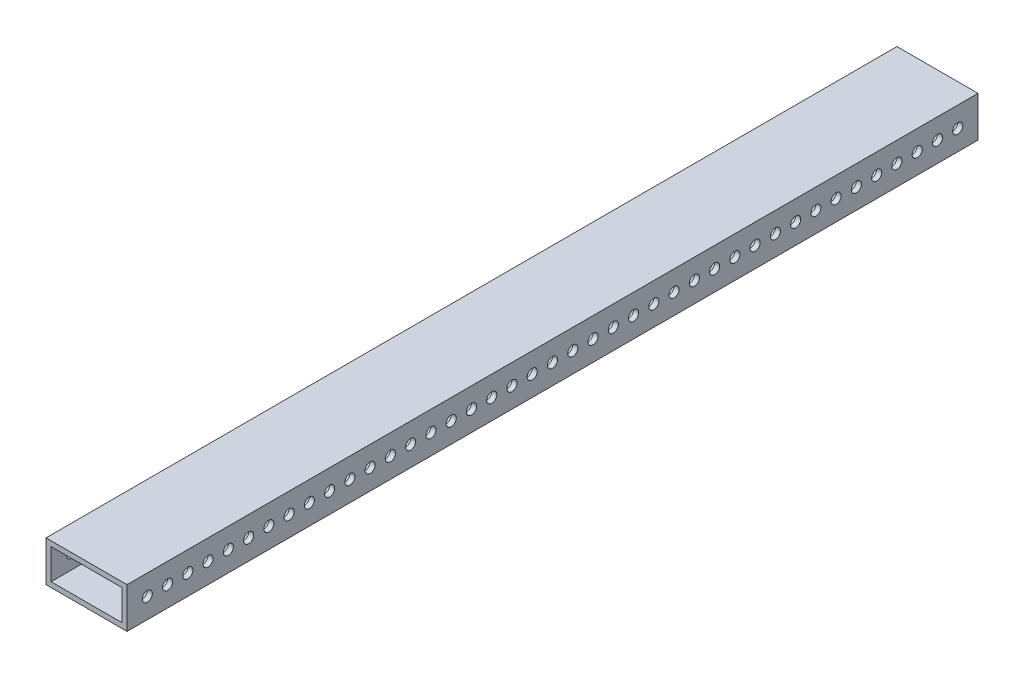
ISO-10303-21;
HEADER;
FILE_DESCRIPTION(('STEP AP214'),'2;1');
FILE_NAME('part.step','',(''),(''),'','','');
FILE_SCHEMA(('AUTOMOTIVE_DESIGN { 1 0 10303 214 1 1 1 1 }'));
ENDSEC;
DATA;
#1=APPLICATION_CONTEXT('core data for automotive mechanical design processes');
#2=APPLICATION_PROTOCOL_DEFINITION('international standard','automotive_design',2000,#1);
#3=PRODUCT_CONTEXT('',#1,'mechanical');
#4=PRODUCT('Part','Part','',(#3));
#5=PRODUCT_RELATED_PRODUCT_CATEGORY('part','',(#4));
#6=PRODUCT_DEFINITION_FORMATION('','',#4);
#7=PRODUCT_DEFINITION_CONTEXT('part definition',#1,'design');
#8=PRODUCT_DEFINITION('design','',#6,#7);
#9=PRODUCT_DEFINITION_SHAPE('','',#8);
#10=(LENGTH_UNIT() NAMED_UNIT(*) SI_UNIT(.MILLI.,.METRE.));
#11=(NAMED_UNIT(*) PLANE_ANGLE_UNIT() SI_UNIT($,.RADIAN.));
#12=(NAMED_UNIT(*) SI_UNIT($,.STERADIAN.) SOLID_ANGLE_UNIT());
#13=UNCERTAINTY_MEASURE_WITH_UNIT(LENGTH_MEASURE(1.E-05),#10,'distance_accuracy_value','');
#14=(GEOMETRIC_REPRESENTATION_CONTEXT(3) GLOBAL_UNCERTAINTY_ASSIGNED_CONTEXT((#13)) GLOBAL_UNIT_ASSIGNED_CONTEXT((#10,
#11,#12)) REPRESENTATION_CONTEXT('',''));
#15=CARTESIAN_POINT('',(0.,0.,0.));
#16=DIRECTION('',(0.,0.,1.));
#17=DIRECTION('',(1.,0.,0.));
#18=AXIS2_PLACEMENT_3D('',#15,#16,#17);
#19=CARTESIAN_POINT('',(0.,0.,266.7));
#20=DIRECTION('',(0.,0.,1.));
#21=DIRECTION('',(1.,0.,0.));
#22=AXIS2_PLACEMENT_3D('',#19,#20,#21);
#23=PLANE('',#22);
#24=DIRECTION('',(0.,-1.,0.));
#25=VECTOR('',#24,1.);
#26=CARTESIAN_POINT('',(-25.4,-12.7,266.7));
#27=LINE('',#26,#25);
#28=CARTESIAN_POINT('',(-25.4,12.7,266.7));
#29=VERTEX_POINT('',#28);
#30=CARTESIAN_POINT('',(-25.4,-12.7,266.7));
#31=VERTEX_POINT('',#30);
#32=EDGE_CURVE('E137',#29,#31,#27,.T.);
#33=ORIENTED_EDGE('',*,*,#32,.T.);
#34=DIRECTION('',(1.,0.,0.));
#35=VECTOR('',#34,1.);
#36=CARTESIAN_POINT('',(25.4,-12.7,266.7));
#37=LINE('',#36,#35);
#38=CARTESIAN_POINT('',(25.4,-12.7,266.7));
#39=VERTEX_POINT('',#38);
#40=EDGE_CURVE('E140',#31,#39,#37,.T.);
#41=ORIENTED_EDGE('',*,*,#40,.T.);
#42=DIRECTION('',(0.,1.,0.));
#43=VECTOR('',#42,1.);
#44=CARTESIAN_POINT('',(25.4,-12.7,266.7));
#45=LINE('',#44,#43);
#46=CARTESIAN_POINT('',(25.4,12.7,266.7));
#47=VERTEX_POINT('',#46);
#48=EDGE_CURVE('E143',#39,#47,#45,.T.);
#49=ORIENTED_EDGE('',*,*,#48,.T.);
#50=DIRECTION('',(-1.,0.,0.));
#51=VECTOR('',#50,1.);
#52=CARTESIAN_POINT('',(25.4,12.7,266.7));
#53=LINE('',#52,#51);
#54=EDGE_CURVE('E145',#47,#29,#53,.T.);
#55=ORIENTED_EDGE('',*,*,#54,.T.);
#56=EDGE_LOOP('',(#33,#41,#49,#55));
#57=FACE_BOUND('',#56,.T.);
#58=DIRECTION('',(1.,0.,0.));
#59=VECTOR('',#58,1.);
#60=CARTESIAN_POINT('',(22.225,-9.525,266.7));
#61=LINE('',#60,#59);
#62=CARTESIAN_POINT('',(-22.225,-9.525,266.7));
#63=VERTEX_POINT('',#62);
#64=CARTESIAN_POINT('',(22.225,-9.525,266.7));
#65=VERTEX_POINT('',#64);
#66=EDGE_CURVE('E107',#63,#65,#61,.T.);
#67=ORIENTED_EDGE('',*,*,#66,.F.);
#68=DIRECTION('',(0.,-1.,0.));
#69=VECTOR('',#68,1.);
#70=CARTESIAN_POINT('',(-22.225,-9.525,266.7));
#71=LINE('',#70,#69);
#72=CARTESIAN_POINT('',(-22.225,9.52499999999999,266.7));
#73=VERTEX_POINT('',#72);
#74=EDGE_CURVE('E98',#73,#63,#71,.T.);
#75=ORIENTED_EDGE('',*,*,#74,.F.);
#76=DIRECTION('',(-1.,0.,0.));
#77=VECTOR('',#76,1.);
#78=CARTESIAN_POINT('',(22.225,9.52499999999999,266.7));
#79=LINE('',#78,#77);
#80=CARTESIAN_POINT('',(22.225,9.52499999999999,266.7));
#81=VERTEX_POINT('',#80);
#82=EDGE_CURVE('E121',#81,#73,#79,.T.);
#83=ORIENTED_EDGE('',*,*,#82,.F.);
#84=DIRECTION('',(0.,1.,0.));
#85=VECTOR('',#84,1.);
#86=CARTESIAN_POINT('',(22.225,-9.525,266.7));
#87=LINE('',#86,#85);
#88=EDGE_CURVE('E119',#65,#81,#87,.T.);
#89=ORIENTED_EDGE('',*,*,#88,.F.);
#90=EDGE_LOOP('',(#67,#75,#83,#89));
#91=FACE_BOUND('',#90,.T.);
#92=ADVANCED_FACE('F33',(#57,#91),#23,.T.);
#93=CARTESIAN_POINT('',(0.,0.,-266.7));
#94=DIRECTION('',(0.,0.,1.));
#95=DIRECTION('',(1.,0.,0.));
#96=AXIS2_PLACEMENT_3D('',#93,#94,#95);
#97=PLANE('',#96);
#98=DIRECTION('',(0.,-1.,0.));
#99=VECTOR('',#98,1.);
#100=CARTESIAN_POINT('',(-25.4,-12.7,-266.7));
#101=LINE('',#100,#99);
#102=CARTESIAN_POINT('',(-25.4,12.7,-266.7));
#103=VERTEX_POINT('',#102);
#104=CARTESIAN_POINT('',(-25.4,-12.7,-266.7));
#105=VERTEX_POINT('',#104);
#106=EDGE_CURVE('E115',#103,#105,#101,.T.);
#107=ORIENTED_EDGE('',*,*,#106,.F.);
#108=DIRECTION('',(-1.,0.,0.));
#109=VECTOR('',#108,1.);
#110=CARTESIAN_POINT('',(25.4,12.7,-266.7));
#111=LINE('',#110,#109);
#112=CARTESIAN_POINT('',(25.4,12.7,-266.7));
#113=VERTEX_POINT('',#112);
#114=EDGE_CURVE('E141',#113,#103,#111,.T.);
#115=ORIENTED_EDGE('',*,*,#114,.F.);
#116=DIRECTION('',(0.,1.,0.));
#117=VECTOR('',#116,1.);
#118=CARTESIAN_POINT('',(25.4,-12.7,-266.7));
#119=LINE('',#118,#117);
#120=CARTESIAN_POINT('',(25.4,-12.7,-266.7));
#121=VERTEX_POINT('',#120);
#122=EDGE_CURVE('E152',#121,#113,#119,.T.);
#123=ORIENTED_EDGE('',*,*,#122,.F.);
#124=DIRECTION('',(1.,0.,0.));
#125=VECTOR('',#124,1.);
#126=CARTESIAN_POINT('',(25.4,-12.7,-266.7));
#127=LINE('',#126,#125);
#128=EDGE_CURVE('E150',#105,#121,#127,.T.);
#129=ORIENTED_EDGE('',*,*,#128,.F.);
#130=EDGE_LOOP('',(#107,#115,#123,#129));
#131=FACE_BOUND('',#130,.T.);
#132=DIRECTION('',(0.,-1.,0.));
#133=VECTOR('',#132,1.);
#134=CARTESIAN_POINT('',(-22.225,-9.525,-266.7));
#135=LINE('',#134,#133);
#136=CARTESIAN_POINT('',(-22.225,9.52499999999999,-266.7));
#137=VERTEX_POINT('',#136);
#138=CARTESIAN_POINT('',(-22.225,-9.525,-266.7));
#139=VERTEX_POINT('',#138);
#140=EDGE_CURVE('E56',#137,#139,#135,.T.);
#141=ORIENTED_EDGE('',*,*,#140,.T.);
#142=DIRECTION('',(1.,0.,0.));
#143=VECTOR('',#142,1.);
#144=CARTESIAN_POINT('',(22.225,-9.525,-266.7));
#145=LINE('',#144,#143);
#146=CARTESIAN_POINT('',(22.225,-9.525,-266.7));
#147=VERTEX_POINT('',#146);
#148=EDGE_CURVE('E114',#139,#147,#145,.T.);
#149=ORIENTED_EDGE('',*,*,#148,.T.);
#150=DIRECTION('',(0.,1.,0.));
#151=VECTOR('',#150,1.);
#152=CARTESIAN_POINT('',(22.225,-9.525,-266.7));
#153=LINE('',#152,#151);
#154=CARTESIAN_POINT('',(22.225,9.52499999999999,-266.7));
#155=VERTEX_POINT('',#154);
#156=EDGE_CURVE('E129',#147,#155,#153,.T.);
#157=ORIENTED_EDGE('',*,*,#156,.T.);
#158=DIRECTION('',(-1.,0.,0.));
#159=VECTOR('',#158,1.);
#160=CARTESIAN_POINT('',(22.225,9.52499999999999,-266.7));
#161=LINE('',#160,#159);
#162=EDGE_CURVE('E108',#155,#137,#161,.T.);
#163=ORIENTED_EDGE('',*,*,#162,.T.);
#164=EDGE_LOOP('',(#141,#149,#157,#163));
#165=FACE_BOUND('',#164,.T.);
#166=ADVANCED_FACE('F651',(#131,#165),#97,.F.);
#167=CARTESIAN_POINT('',(-25.4,-12.7,266.7));
#168=DIRECTION('',(1.,0.,0.));
#169=DIRECTION('',(0.,0.,-1.));
#170=AXIS2_PLACEMENT_3D('',#167,#168,#169);
#171=PLANE('',#170);
#172=CARTESIAN_POINT('',(-25.4,0.,241.3));
#173=DIRECTION('',(1.,0.,0.));
#174=DIRECTION('',(0.,0.,-1.));
#175=AXIS2_PLACEMENT_3D('',#172,#173,#174);
#176=CIRCLE('',#175,3.17499999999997);
#177=CARTESIAN_POINT('',(-25.4,0.,238.125));
#178=VERTEX_POINT('',#177);
#179=EDGE_CURVE('E1561',#178,#178,#176,.T.);
#180=ORIENTED_EDGE('',*,*,#179,.T.);
#181=EDGE_LOOP('',(#180));
#182=FACE_BOUND('',#181,.T.);
#183=CARTESIAN_POINT('',(-25.4,0.,254.));
#184=DIRECTION('',(1.,0.,0.));
#185=DIRECTION('',(0.,0.,-1.));
#186=AXIS2_PLACEMENT_3D('',#183,#184,#185);
#187=CIRCLE('',#186,3.17499999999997);
#188=CARTESIAN_POINT('',(-25.4,0.,250.825));
#189=VERTEX_POINT('',#188);
#190=EDGE_CURVE('E170',#189,#189,#187,.T.);
#191=ORIENTED_EDGE('',*,*,#190,.T.);
#192=EDGE_LOOP('',(#191));
#193=FACE_BOUND('',#192,.T.);
#194=ORIENTED_EDGE('',*,*,#106,.T.);
#195=DIRECTION('',(0.,0.,-1.));
#196=VECTOR('',#195,1.);
#197=CARTESIAN_POINT('',(-25.4,-12.7,266.7));
#198=LINE('',#197,#196);
#199=EDGE_CURVE('E163',#31,#105,#198,.T.);
#200=ORIENTED_EDGE('',*,*,#199,.F.);
#201=ORIENTED_EDGE('',*,*,#32,.F.);
#202=DIRECTION('',(0.,0.,-1.));
#203=VECTOR('',#202,1.);
#204=CARTESIAN_POINT('',(-25.4,12.7,266.7));
#205=LINE('',#204,#203);
#206=EDGE_CURVE('E147',#29,#103,#205,.T.);
#207=ORIENTED_EDGE('',*,*,#206,.T.);
#208=EDGE_LOOP('',(#194,#200,#201,#207));
#209=FACE_BOUND('',#208,.T.);
#210=CARTESIAN_POINT('',(-25.4,0.,228.6));
#211=DIRECTION('',(1.,0.,0.));
#212=DIRECTION('',(0.,0.,-1.));
#213=AXIS2_PLACEMENT_3D('',#210,#211,#212);
#214=CIRCLE('',#213,3.17499999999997);
#215=CARTESIAN_POINT('',(-25.4,0.,225.425));
#216=VERTEX_POINT('',#215);
#217=EDGE_CURVE('E173',#216,#216,#214,.T.);
#218=ORIENTED_EDGE('',*,*,#217,.T.);
#219=EDGE_LOOP('',(#218));
#220=FACE_BOUND('',#219,.T.);
#221=CARTESIAN_POINT('',(-25.4,0.,215.9));
#222=DIRECTION('',(1.,0.,0.));
#223=DIRECTION('',(0.,0.,-1.));
#224=AXIS2_PLACEMENT_3D('',#221,#222,#223);
#225=CIRCLE('',#224,3.17499999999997);
#226=CARTESIAN_POINT('',(-25.4,0.,212.725));
#227=VERTEX_POINT('',#226);
#228=EDGE_CURVE('E179',#227,#227,#225,.T.);
#229=ORIENTED_EDGE('',*,*,#228,.T.);
#230=EDGE_LOOP('',(#229));
#231=FACE_BOUND('',#230,.T.);
#232=CARTESIAN_POINT('',(-25.4,0.,203.2));
#233=DIRECTION('',(1.,0.,0.));
#234=DIRECTION('',(0.,0.,-1.));
#235=AXIS2_PLACEMENT_3D('',#232,#233,#234);
#236=CIRCLE('',#235,3.17499999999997);
#237=CARTESIAN_POINT('',(-25.4,0.,200.025));
#238=VERTEX_POINT('',#237);
#239=EDGE_CURVE('E185',#238,#238,#236,.T.);
#240=ORIENTED_EDGE('',*,*,#239,.T.);
#241=EDGE_LOOP('',(#240));
#242=FACE_BOUND('',#241,.T.);
#243=CARTESIAN_POINT('',(-25.4,0.,190.5));
#244=DIRECTION('',(1.,0.,0.));
#245=DIRECTION('',(0.,0.,-1.));
#246=AXIS2_PLACEMENT_3D('',#243,#244,#245);
#247=CIRCLE('',#246,3.17499999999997);
#248=CARTESIAN_POINT('',(-25.4,0.,187.325));
#249=VERTEX_POINT('',#248);
#250=EDGE_CURVE('E191',#249,#249,#247,.T.);
#251=ORIENTED_EDGE('',*,*,#250,.T.);
#252=EDGE_LOOP('',(#251));
#253=FACE_BOUND('',#252,.T.);
#254=CARTESIAN_POINT('',(-25.4,0.,177.8));
#255=DIRECTION('',(1.,0.,0.));
#256=DIRECTION('',(0.,0.,-1.));
#257=AXIS2_PLACEMENT_3D('',#254,#255,#256);
#258=CIRCLE('',#257,3.17499999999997);
#259=CARTESIAN_POINT('',(-25.4,0.,174.625));
#260=VERTEX_POINT('',#259);
#261=EDGE_CURVE('E197',#260,#260,#258,.T.);
#262=ORIENTED_EDGE('',*,*,#261,.T.);
#263=EDGE_LOOP('',(#262));
#264=FACE_BOUND('',#263,.T.);
#265=CARTESIAN_POINT('',(-25.4,0.,165.1));
#266=DIRECTION('',(1.,0.,0.));
#267=DIRECTION('',(0.,0.,-1.));
#268=AXIS2_PLACEMENT_3D('',#265,#266,#267);
#269=CIRCLE('',#268,3.17499999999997);
#270=CARTESIAN_POINT('',(-25.4,0.,161.925));
#271=VERTEX_POINT('',#270);
#272=EDGE_CURVE('E203',#271,#271,#269,.T.);
#273=ORIENTED_EDGE('',*,*,#272,.T.);
#274=EDGE_LOOP('',(#273));
#275=FACE_BOUND('',#274,.T.);
#276=CARTESIAN_POINT('',(-25.4,0.,152.4));
#277=DIRECTION('',(1.,0.,0.));
#278=DIRECTION('',(0.,0.,-1.));
#279=AXIS2_PLACEMENT_3D('',#276,#277,#278);
#280=CIRCLE('',#279,3.17499999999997);
#281=CARTESIAN_POINT('',(-25.4,0.,149.225));
#282=VERTEX_POINT('',#281);
#283=EDGE_CURVE('E209',#282,#282,#280,.T.);
#284=ORIENTED_EDGE('',*,*,#283,.T.);
#285=EDGE_LOOP('',(#284));
#286=FACE_BOUND('',#285,.T.);
#287=CARTESIAN_POINT('',(-25.4,0.,139.7));
#288=DIRECTION('',(1.,0.,0.));
#289=DIRECTION('',(0.,0.,-1.));
#290=AXIS2_PLACEMENT_3D('',#287,#288,#289);
#291=CIRCLE('',#290,3.17499999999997);
#292=CARTESIAN_POINT('',(-25.4,0.,136.525));
#293=VERTEX_POINT('',#292);
#294=EDGE_CURVE('E215',#293,#293,#291,.T.);
#295=ORIENTED_EDGE('',*,*,#294,.T.);
#296=EDGE_LOOP('',(#295));
#297=FACE_BOUND('',#296,.T.);
#298=CARTESIAN_POINT('',(-25.4,0.,127.));
#299=DIRECTION('',(1.,0.,0.));
#300=DIRECTION('',(0.,0.,-1.));
#301=AXIS2_PLACEMENT_3D('',#298,#299,#300);
#302=CIRCLE('',#301,3.17499999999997);
#303=CARTESIAN_POINT('',(-25.4,0.,123.825));
#304=VERTEX_POINT('',#303);
#305=EDGE_CURVE('E221',#304,#304,#302,.T.);
#306=ORIENTED_EDGE('',*,*,#305,.T.);
#307=EDGE_LOOP('',(#306));
#308=FACE_BOUND('',#307,.T.);
#309=CARTESIAN_POINT('',(-25.4,0.,114.3));
#310=DIRECTION('',(1.,0.,0.));
#311=DIRECTION('',(0.,0.,-1.));
#312=AXIS2_PLACEMENT_3D('',#309,#310,#311);
#313=CIRCLE('',#312,3.17499999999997);
#314=CARTESIAN_POINT('',(-25.4,0.,111.125));
#315=VERTEX_POINT('',#314);
#316=EDGE_CURVE('E227',#315,#315,#313,.T.);
#317=ORIENTED_EDGE('',*,*,#316,.T.);
#318=EDGE_LOOP('',(#317));
#319=FACE_BOUND('',#318,.T.);
#320=CARTESIAN_POINT('',(-25.4,0.,101.6));
#321=DIRECTION('',(1.,0.,0.));
#322=DIRECTION('',(0.,0.,-1.));
#323=AXIS2_PLACEMENT_3D('',#320,#321,#322);
#324=CIRCLE('',#323,3.17499999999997);
#325=CARTESIAN_POINT('',(-25.4,0.,98.4250000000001));
#326=VERTEX_POINT('',#325);
#327=EDGE_CURVE('E233',#326,#326,#324,.T.);
#328=ORIENTED_EDGE('',*,*,#327,.T.);
#329=EDGE_LOOP('',(#328));
#330=FACE_BOUND('',#329,.T.);
#331=CARTESIAN_POINT('',(-25.4,0.,88.9));
#332=DIRECTION('',(1.,0.,0.));
#333=DIRECTION('',(0.,0.,-1.));
#334=AXIS2_PLACEMENT_3D('',#331,#332,#333);
#335=CIRCLE('',#334,3.17499999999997);
#336=CARTESIAN_POINT('',(-25.4,0.,85.725));
#337=VERTEX_POINT('',#336);
#338=EDGE_CURVE('E239',#337,#337,#335,.T.);
#339=ORIENTED_EDGE('',*,*,#338,.T.);
#340=EDGE_LOOP('',(#339));
#341=FACE_BOUND('',#340,.T.);
#342=CARTESIAN_POINT('',(-25.4,0.,76.2));
#343=DIRECTION('',(1.,0.,0.));
#344=DIRECTION('',(0.,0.,-1.));
#345=AXIS2_PLACEMENT_3D('',#342,#343,#344);
#346=CIRCLE('',#345,3.17499999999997);
#347=CARTESIAN_POINT('',(-25.4,0.,73.025));
#348=VERTEX_POINT('',#347);
#349=EDGE_CURVE('E245',#348,#348,#346,.T.);
#350=ORIENTED_EDGE('',*,*,#349,.T.);
#351=EDGE_LOOP('',(#350));
#352=FACE_BOUND('',#351,.T.);
#353=CARTESIAN_POINT('',(-25.4,0.,63.5));
#354=DIRECTION('',(1.,0.,0.));
#355=DIRECTION('',(0.,0.,-1.));
#356=AXIS2_PLACEMENT_3D('',#353,#354,#355);
#357=CIRCLE('',#356,3.17499999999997);
#358=CARTESIAN_POINT('',(-25.4,0.,60.325));
#359=VERTEX_POINT('',#358);
#360=EDGE_CURVE('E251',#359,#359,#357,.T.);
#361=ORIENTED_EDGE('',*,*,#360,.T.);
#362=EDGE_LOOP('',(#361));
#363=FACE_BOUND('',#362,.T.);
#364=CARTESIAN_POINT('',(-25.4,0.,50.8));
#365=DIRECTION('',(1.,0.,0.));
#366=DIRECTION('',(0.,0.,-1.));
#367=AXIS2_PLACEMENT_3D('',#364,#365,#366);
#368=CIRCLE('',#367,3.17499999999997);
#369=CARTESIAN_POINT('',(-25.4,0.,47.625));
#370=VERTEX_POINT('',#369);
#371=EDGE_CURVE('E257',#370,#370,#368,.T.);
#372=ORIENTED_EDGE('',*,*,#371,.T.);
#373=EDGE_LOOP('',(#372));
#374=FACE_BOUND('',#373,.T.);
#375=CARTESIAN_POINT('',(-25.4,0.,38.1));
#376=DIRECTION('',(1.,0.,0.));
#377=DIRECTION('',(0.,0.,-1.));
#378=AXIS2_PLACEMENT_3D('',#375,#376,#377);
#379=CIRCLE('',#378,3.17499999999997);
#380=CARTESIAN_POINT('',(-25.4,0.,34.9250000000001));
#381=VERTEX_POINT('',#380);
#382=EDGE_CURVE('E263',#381,#381,#379,.T.);
#383=ORIENTED_EDGE('',*,*,#382,.T.);
#384=EDGE_LOOP('',(#383));
#385=FACE_BOUND('',#384,.T.);
#386=CARTESIAN_POINT('',(-25.4,0.,25.4));
#387=DIRECTION('',(1.,0.,0.));
#388=DIRECTION('',(0.,0.,-1.));
#389=AXIS2_PLACEMENT_3D('',#386,#387,#388);
#390=CIRCLE('',#389,3.17499999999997);
#391=CARTESIAN_POINT('',(-25.4,0.,22.225));
#392=VERTEX_POINT('',#391);
#393=EDGE_CURVE('E269',#392,#392,#390,.T.);
#394=ORIENTED_EDGE('',*,*,#393,.T.);
#395=EDGE_LOOP('',(#394));
#396=FACE_BOUND('',#395,.T.);
#397=CARTESIAN_POINT('',(-25.4,0.,12.7));
#398=DIRECTION('',(1.,0.,0.));
#399=DIRECTION('',(0.,0.,-1.));
#400=AXIS2_PLACEMENT_3D('',#397,#398,#399);
#401=CIRCLE('',#400,3.17499999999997);
#402=CARTESIAN_POINT('',(-25.4,0.,9.52500000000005));
#403=VERTEX_POINT('',#402);
#404=EDGE_CURVE('E275',#403,#403,#401,.T.);
#405=ORIENTED_EDGE('',*,*,#404,.T.);
#406=EDGE_LOOP('',(#405));
#407=FACE_BOUND('',#406,.T.);
#408=CARTESIAN_POINT('',(-25.4,0.,0.));
#409=DIRECTION('',(1.,0.,0.));
#410=DIRECTION('',(0.,0.,-1.));
#411=AXIS2_PLACEMENT_3D('',#408,#409,#410);
#412=CIRCLE('',#411,3.17499999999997);
#413=CARTESIAN_POINT('',(-25.4,0.,-3.17499999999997));
#414=VERTEX_POINT('',#413);
#415=EDGE_CURVE('E281',#414,#414,#412,.T.);
#416=ORIENTED_EDGE('',*,*,#415,.T.);
#417=EDGE_LOOP('',(#416));
#418=FACE_BOUND('',#417,.T.);
#419=CARTESIAN_POINT('',(-25.4,0.,-12.7));
#420=DIRECTION('',(1.,0.,0.));
#421=DIRECTION('',(0.,0.,-1.));
#422=AXIS2_PLACEMENT_3D('',#419,#420,#421);
#423=CIRCLE('',#422,3.17499999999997);
#424=CARTESIAN_POINT('',(-25.4,0.,-15.875));
#425=VERTEX_POINT('',#424);
#426=EDGE_CURVE('E287',#425,#425,#423,.T.);
#427=ORIENTED_EDGE('',*,*,#426,.T.);
#428=EDGE_LOOP('',(#427));
#429=FACE_BOUND('',#428,.T.);
#430=CARTESIAN_POINT('',(-25.4,0.,-25.4));
#431=DIRECTION('',(1.,0.,0.));
#432=DIRECTION('',(0.,0.,-1.));
#433=AXIS2_PLACEMENT_3D('',#430,#431,#432);
#434=CIRCLE('',#433,3.17499999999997);
#435=CARTESIAN_POINT('',(-25.4,0.,-28.5749999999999));
#436=VERTEX_POINT('',#435);
#437=EDGE_CURVE('E293',#436,#436,#434,.T.);
#438=ORIENTED_EDGE('',*,*,#437,.T.);
#439=EDGE_LOOP('',(#438));
#440=FACE_BOUND('',#439,.T.);
#441=CARTESIAN_POINT('',(-25.4,0.,-38.1));
#442=DIRECTION('',(1.,0.,0.));
#443=DIRECTION('',(0.,0.,-1.));
#444=AXIS2_PLACEMENT_3D('',#441,#442,#443);
#445=CIRCLE('',#444,3.17499999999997);
#446=CARTESIAN_POINT('',(-25.4,0.,-41.2749999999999));
#447=VERTEX_POINT('',#446);
#448=EDGE_CURVE('E299',#447,#447,#445,.T.);
#449=ORIENTED_EDGE('',*,*,#448,.T.);
#450=EDGE_LOOP('',(#449));
#451=FACE_BOUND('',#450,.T.);
#452=CARTESIAN_POINT('',(-25.4,0.,-50.8));
#453=DIRECTION('',(1.,0.,0.));
#454=DIRECTION('',(0.,0.,-1.));
#455=AXIS2_PLACEMENT_3D('',#452,#453,#454);
#456=CIRCLE('',#455,3.17499999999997);
#457=CARTESIAN_POINT('',(-25.4,0.,-53.9749999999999));
#458=VERTEX_POINT('',#457);
#459=EDGE_CURVE('E305',#458,#458,#456,.T.);
#460=ORIENTED_EDGE('',*,*,#459,.T.);
#461=EDGE_LOOP('',(#460));
#462=FACE_BOUND('',#461,.T.);
#463=CARTESIAN_POINT('',(-25.4,0.,-63.5));
#464=DIRECTION('',(1.,0.,0.));
#465=DIRECTION('',(0.,0.,-1.));
#466=AXIS2_PLACEMENT_3D('',#463,#464,#465);
#467=CIRCLE('',#466,3.17499999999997);
#468=CARTESIAN_POINT('',(-25.4,0.,-66.675));
#469=VERTEX_POINT('',#468);
#470=EDGE_CURVE('E311',#469,#469,#467,.T.);
#471=ORIENTED_EDGE('',*,*,#470,.T.);
#472=EDGE_LOOP('',(#471));
#473=FACE_BOUND('',#472,.T.);
#474=CARTESIAN_POINT('',(-25.4,0.,-76.2));
#475=DIRECTION('',(1.,0.,0.));
#476=DIRECTION('',(0.,0.,-1.));
#477=AXIS2_PLACEMENT_3D('',#474,#475,#476);
#478=CIRCLE('',#477,3.17499999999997);
#479=CARTESIAN_POINT('',(-25.4,0.,-79.375));
#480=VERTEX_POINT('',#479);
#481=EDGE_CURVE('E317',#480,#480,#478,.T.);
#482=ORIENTED_EDGE('',*,*,#481,.T.);
#483=EDGE_LOOP('',(#482));
#484=FACE_BOUND('',#483,.T.);
#485=CARTESIAN_POINT('',(-25.4,0.,-88.9));
#486=DIRECTION('',(1.,0.,0.));
#487=DIRECTION('',(0.,0.,-1.));
#488=AXIS2_PLACEMENT_3D('',#485,#486,#487);
#489=CIRCLE('',#488,3.17499999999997);
#490=CARTESIAN_POINT('',(-25.4,0.,-92.0749999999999));
#491=VERTEX_POINT('',#490);
#492=EDGE_CURVE('E323',#491,#491,#489,.T.);
#493=ORIENTED_EDGE('',*,*,#492,.T.);
#494=EDGE_LOOP('',(#493));
#495=FACE_BOUND('',#494,.T.);
#496=CARTESIAN_POINT('',(-25.4,0.,-101.6));
#497=DIRECTION('',(1.,0.,0.));
#498=DIRECTION('',(0.,0.,-1.));
#499=AXIS2_PLACEMENT_3D('',#496,#497,#498);
#500=CIRCLE('',#499,3.17499999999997);
#501=CARTESIAN_POINT('',(-25.4,0.,-104.775));
#502=VERTEX_POINT('',#501);
#503=EDGE_CURVE('E329',#502,#502,#500,.T.);
#504=ORIENTED_EDGE('',*,*,#503,.T.);
#505=EDGE_LOOP('',(#504));
#506=FACE_BOUND('',#505,.T.);
#507=CARTESIAN_POINT('',(-25.4,0.,-114.3));
#508=DIRECTION('',(1.,0.,0.));
#509=DIRECTION('',(0.,0.,-1.));
#510=AXIS2_PLACEMENT_3D('',#507,#508,#509);
#511=CIRCLE('',#510,3.17499999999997);
#512=CARTESIAN_POINT('',(-25.4,0.,-117.475));
#513=VERTEX_POINT('',#512);
#514=EDGE_CURVE('E335',#513,#513,#511,.T.);
#515=ORIENTED_EDGE('',*,*,#514,.T.);
#516=EDGE_LOOP('',(#515));
#517=FACE_BOUND('',#516,.T.);
#518=CARTESIAN_POINT('',(-25.4,0.,-127.));
#519=DIRECTION('',(1.,0.,0.));
#520=DIRECTION('',(0.,0.,-1.));
#521=AXIS2_PLACEMENT_3D('',#518,#519,#520);
#522=CIRCLE('',#521,3.17499999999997);
#523=CARTESIAN_POINT('',(-25.4,0.,-130.175));
#524=VERTEX_POINT('',#523);
#525=EDGE_CURVE('E341',#524,#524,#522,.T.);
#526=ORIENTED_EDGE('',*,*,#525,.T.);
#527=EDGE_LOOP('',(#526));
#528=FACE_BOUND('',#527,.T.);
#529=CARTESIAN_POINT('',(-25.4,0.,-139.7));
#530=DIRECTION('',(1.,0.,0.));
#531=DIRECTION('',(0.,0.,-1.));
#532=AXIS2_PLACEMENT_3D('',#529,#530,#531);
#533=CIRCLE('',#532,3.17499999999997);
#534=CARTESIAN_POINT('',(-25.4,0.,-142.875));
#535=VERTEX_POINT('',#534);
#536=EDGE_CURVE('E347',#535,#535,#533,.T.);
#537=ORIENTED_EDGE('',*,*,#536,.T.);
#538=EDGE_LOOP('',(#537));
#539=FACE_BOUND('',#538,.T.);
#540=CARTESIAN_POINT('',(-25.4,0.,-152.4));
#541=DIRECTION('',(1.,0.,0.));
#542=DIRECTION('',(0.,0.,-1.));
#543=AXIS2_PLACEMENT_3D('',#540,#541,#542);
#544=CIRCLE('',#543,3.17499999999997);
#545=CARTESIAN_POINT('',(-25.4,0.,-155.575));
#546=VERTEX_POINT('',#545);
#547=EDGE_CURVE('E353',#546,#546,#544,.T.);
#548=ORIENTED_EDGE('',*,*,#547,.T.);
#549=EDGE_LOOP('',(#548));
#550=FACE_BOUND('',#549,.T.);
#551=CARTESIAN_POINT('',(-25.4,0.,-165.1));
#552=DIRECTION('',(1.,0.,0.));
#553=DIRECTION('',(0.,0.,-1.));
#554=AXIS2_PLACEMENT_3D('',#551,#552,#553);
#555=CIRCLE('',#554,3.17499999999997);
#556=CARTESIAN_POINT('',(-25.4,0.,-168.275));
#557=VERTEX_POINT('',#556);
#558=EDGE_CURVE('E359',#557,#557,#555,.T.);
#559=ORIENTED_EDGE('',*,*,#558,.T.);
#560=EDGE_LOOP('',(#559));
#561=FACE_BOUND('',#560,.T.);
#562=CARTESIAN_POINT('',(-25.4,0.,-177.8));
#563=DIRECTION('',(1.,0.,0.));
#564=DIRECTION('',(0.,0.,-1.));
#565=AXIS2_PLACEMENT_3D('',#562,#563,#564);
#566=CIRCLE('',#565,3.17499999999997);
#567=CARTESIAN_POINT('',(-25.4,0.,-180.975));
#568=VERTEX_POINT('',#567);
#569=EDGE_CURVE('E365',#568,#568,#566,.T.);
#570=ORIENTED_EDGE('',*,*,#569,.T.);
#571=EDGE_LOOP('',(#570));
#572=FACE_BOUND('',#571,.T.);
#573=CARTESIAN_POINT('',(-25.4,0.,-190.5));
#574=DIRECTION('',(1.,0.,0.));
#575=DIRECTION('',(0.,0.,-1.));
#576=AXIS2_PLACEMENT_3D('',#573,#574,#575);
#577=CIRCLE('',#576,3.17499999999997);
#578=CARTESIAN_POINT('',(-25.4,0.,-193.675));
#579=VERTEX_POINT('',#578);
#580=EDGE_CURVE('E371',#579,#579,#577,.T.);
#581=ORIENTED_EDGE('',*,*,#580,.T.);
#582=EDGE_LOOP('',(#581));
#583=FACE_BOUND('',#582,.T.);
#584=CARTESIAN_POINT('',(-25.4,0.,-203.2));
#585=DIRECTION('',(1.,0.,0.));
#586=DIRECTION('',(0.,0.,-1.));
#587=AXIS2_PLACEMENT_3D('',#584,#585,#586);
#588=CIRCLE('',#587,3.17499999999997);
#589=CARTESIAN_POINT('',(-25.4,0.,-206.375));
#590=VERTEX_POINT('',#589);
#591=EDGE_CURVE('E377',#590,#590,#588,.T.);
#592=ORIENTED_EDGE('',*,*,#591,.T.);
#593=EDGE_LOOP('',(#592));
#594=FACE_BOUND('',#593,.T.);
#595=CARTESIAN_POINT('',(-25.4,0.,-215.9));
#596=DIRECTION('',(1.,0.,0.));
#597=DIRECTION('',(0.,0.,-1.));
#598=AXIS2_PLACEMENT_3D('',#595,#596,#597);
#599=CIRCLE('',#598,3.17499999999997);
#600=CARTESIAN_POINT('',(-25.4,0.,-219.075));
#601=VERTEX_POINT('',#600);
#602=EDGE_CURVE('E383',#601,#601,#599,.T.);
#603=ORIENTED_EDGE('',*,*,#602,.T.);
#604=EDGE_LOOP('',(#603));
#605=FACE_BOUND('',#604,.T.);
#606=CARTESIAN_POINT('',(-25.4,0.,-228.6));
#607=DIRECTION('',(1.,0.,0.));
#608=DIRECTION('',(0.,0.,-1.));
#609=AXIS2_PLACEMENT_3D('',#606,#607,#608);
#610=CIRCLE('',#609,3.17499999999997);
#611=CARTESIAN_POINT('',(-25.4,0.,-231.775));
#612=VERTEX_POINT('',#611);
#613=EDGE_CURVE('E389',#612,#612,#610,.T.);
#614=ORIENTED_EDGE('',*,*,#613,.T.);
#615=EDGE_LOOP('',(#614));
#616=FACE_BOUND('',#615,.T.);
#617=CARTESIAN_POINT('',(-25.4,0.,-241.3));
#618=DIRECTION('',(1.,0.,0.));
#619=DIRECTION('',(0.,0.,-1.));
#620=AXIS2_PLACEMENT_3D('',#617,#618,#619);
#621=CIRCLE('',#620,3.17499999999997);
#622=CARTESIAN_POINT('',(-25.4,0.,-244.475));
#623=VERTEX_POINT('',#622);
#624=EDGE_CURVE('E395',#623,#623,#621,.T.);
#625=ORIENTED_EDGE('',*,*,#624,.T.);
#626=EDGE_LOOP('',(#625));
#627=FACE_BOUND('',#626,.T.);
#628=CARTESIAN_POINT('',(-25.4,0.,-254.));
#629=DIRECTION('',(1.,0.,0.));
#630=DIRECTION('',(0.,0.,-1.));
#631=AXIS2_PLACEMENT_3D('',#628,#629,#630);
#632=CIRCLE('',#631,3.17499999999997);
#633=CARTESIAN_POINT('',(-25.4,0.,-257.175));
#634=VERTEX_POINT('',#633);
#635=EDGE_CURVE('E401',#634,#634,#632,.T.);
#636=ORIENTED_EDGE('',*,*,#635,.T.);
#637=EDGE_LOOP('',(#636));
#638=FACE_BOUND('',#637,.T.);
#639=ADVANCED_FACE('F657',(#182,#193,#209,#220,#231,#242,#253,#264,#275,#286,#297,#308,#319,
#330,#341,#352,#363,#374,#385,#396,#407,#418,#429,#440,#451,#462,#473,#484,#495,#506,#517,#528,
#539,#550,#561,#572,#583,#594,#605,#616,#627,#638),#171,.F.);
#640=CARTESIAN_POINT('',(25.4,-12.7,266.7));
#641=DIRECTION('',(0.,1.,0.));
#642=DIRECTION('',(-1.,0.,0.));
#643=AXIS2_PLACEMENT_3D('',#640,#641,#642);
#644=PLANE('',#643);
#645=ORIENTED_EDGE('',*,*,#128,.T.);
#646=DIRECTION('',(0.,0.,-1.));
#647=VECTOR('',#646,1.);
#648=CARTESIAN_POINT('',(25.4,-12.7,266.7));
#649=LINE('',#648,#647);
#650=EDGE_CURVE('E160',#39,#121,#649,.T.);
#651=ORIENTED_EDGE('',*,*,#650,.F.);
#652=ORIENTED_EDGE('',*,*,#40,.F.);
#653=ORIENTED_EDGE('',*,*,#199,.T.);
#654=EDGE_LOOP('',(#645,#651,#652,#653));
#655=FACE_BOUND('',#654,.T.);
#656=ADVANCED_FACE('F669',(#655),#644,.F.);
#657=CARTESIAN_POINT('',(25.4,-12.7,266.7));
#658=DIRECTION('',(-1.,0.,0.));
#659=DIRECTION('',(0.,0.,1.));
#660=AXIS2_PLACEMENT_3D('',#657,#658,#659);
#661=PLANE('',#660);
#662=CARTESIAN_POINT('',(25.4,0.,241.3));
#663=DIRECTION('',(1.,0.,0.));
#664=DIRECTION('',(0.,0.,-1.));
#665=AXIS2_PLACEMENT_3D('',#662,#663,#664);
#666=CIRCLE('',#665,3.17499999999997);
#667=CARTESIAN_POINT('',(25.4,0.,238.125));
#668=VERTEX_POINT('',#667);
#669=EDGE_CURVE('E1894',#668,#668,#666,.T.);
#670=ORIENTED_EDGE('',*,*,#669,.F.);
#671=EDGE_LOOP('',(#670));
#672=FACE_BOUND('',#671,.T.);
#673=CARTESIAN_POINT('',(25.4,0.,254.));
#674=DIRECTION('',(1.,0.,0.));
#675=DIRECTION('',(0.,0.,-1.));
#676=AXIS2_PLACEMENT_3D('',#673,#674,#675);
#677=CIRCLE('',#676,3.17499999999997);
#678=CARTESIAN_POINT('',(25.4,0.,250.825));
#679=VERTEX_POINT('',#678);
#680=EDGE_CURVE('E1559',#679,#679,#677,.T.);
#681=ORIENTED_EDGE('',*,*,#680,.F.);
#682=EDGE_LOOP('',(#681));
#683=FACE_BOUND('',#682,.T.);
#684=ORIENTED_EDGE('',*,*,#122,.T.);
#685=DIRECTION('',(0.,0.,-1.));
#686=VECTOR('',#685,1.);
#687=CARTESIAN_POINT('',(25.4,12.7,266.7));
#688=LINE('',#687,#686);
#689=EDGE_CURVE('E157',#47,#113,#688,.T.);
#690=ORIENTED_EDGE('',*,*,#689,.F.);
#691=ORIENTED_EDGE('',*,*,#48,.F.);
#692=ORIENTED_EDGE('',*,*,#650,.T.);
#693=EDGE_LOOP('',(#684,#690,#691,#692));
#694=FACE_BOUND('',#693,.T.);
#695=CARTESIAN_POINT('',(25.4,0.,228.6));
#696=DIRECTION('',(1.,0.,0.));
#697=DIRECTION('',(0.,0.,-1.));
#698=AXIS2_PLACEMENT_3D('',#695,#696,#697);
#699=CIRCLE('',#698,3.17499999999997);
#700=CARTESIAN_POINT('',(25.4,0.,225.425));
#701=VERTEX_POINT('',#700);
#702=EDGE_CURVE('E407',#701,#701,#699,.T.);
#703=ORIENTED_EDGE('',*,*,#702,.F.);
#704=EDGE_LOOP('',(#703));
#705=FACE_BOUND('',#704,.T.);
#706=CARTESIAN_POINT('',(25.4,0.,215.9));
#707=DIRECTION('',(1.,0.,0.));
#708=DIRECTION('',(0.,0.,-1.));
#709=AXIS2_PLACEMENT_3D('',#706,#707,#708);
#710=CIRCLE('',#709,3.17499999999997);
#711=CARTESIAN_POINT('',(25.4,0.,212.725));
#712=VERTEX_POINT('',#711);
#713=EDGE_CURVE('E413',#712,#712,#710,.T.);
#714=ORIENTED_EDGE('',*,*,#713,.F.);
#715=EDGE_LOOP('',(#714));
#716=FACE_BOUND('',#715,.T.);
#717=CARTESIAN_POINT('',(25.4,0.,203.2));
#718=DIRECTION('',(1.,0.,0.));
#719=DIRECTION('',(0.,0.,-1.));
#720=AXIS2_PLACEMENT_3D('',#717,#718,#719);
#721=CIRCLE('',#720,3.17499999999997);
#722=CARTESIAN_POINT('',(25.4,0.,200.025));
#723=VERTEX_POINT('',#722);
#724=EDGE_CURVE('E419',#723,#723,#721,.T.);
#725=ORIENTED_EDGE('',*,*,#724,.F.);
#726=EDGE_LOOP('',(#725));
#727=FACE_BOUND('',#726,.T.);
#728=CARTESIAN_POINT('',(25.4,0.,190.5));
#729=DIRECTION('',(1.,0.,0.));
#730=DIRECTION('',(0.,0.,-1.));
#731=AXIS2_PLACEMENT_3D('',#728,#729,#730);
#732=CIRCLE('',#731,3.17499999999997);
#733=CARTESIAN_POINT('',(25.4,0.,187.325));
#734=VERTEX_POINT('',#733);
#735=EDGE_CURVE('E425',#734,#734,#732,.T.);
#736=ORIENTED_EDGE('',*,*,#735,.F.);
#737=EDGE_LOOP('',(#736));
#738=FACE_BOUND('',#737,.T.);
#739=CARTESIAN_POINT('',(25.4,0.,177.8));
#740=DIRECTION('',(1.,0.,0.));
#741=DIRECTION('',(0.,0.,-1.));
#742=AXIS2_PLACEMENT_3D('',#739,#740,#741);
#743=CIRCLE('',#742,3.17499999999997);
#744=CARTESIAN_POINT('',(25.4,0.,174.625));
#745=VERTEX_POINT('',#744);
#746=EDGE_CURVE('E431',#745,#745,#743,.T.);
#747=ORIENTED_EDGE('',*,*,#746,.F.);
#748=EDGE_LOOP('',(#747));
#749=FACE_BOUND('',#748,.T.);
#750=CARTESIAN_POINT('',(25.4,0.,165.1));
#751=DIRECTION('',(1.,0.,0.));
#752=DIRECTION('',(0.,0.,-1.));
#753=AXIS2_PLACEMENT_3D('',#750,#751,#752);
#754=CIRCLE('',#753,3.17499999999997);
#755=CARTESIAN_POINT('',(25.4,0.,161.925));
#756=VERTEX_POINT('',#755);
#757=EDGE_CURVE('E437',#756,#756,#754,.T.);
#758=ORIENTED_EDGE('',*,*,#757,.F.);
#759=EDGE_LOOP('',(#758));
#760=FACE_BOUND('',#759,.T.);
#761=CARTESIAN_POINT('',(25.4,0.,152.4));
#762=DIRECTION('',(1.,0.,0.));
#763=DIRECTION('',(0.,0.,-1.));
#764=AXIS2_PLACEMENT_3D('',#761,#762,#763);
#765=CIRCLE('',#764,3.17499999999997);
#766=CARTESIAN_POINT('',(25.4,0.,149.225));
#767=VERTEX_POINT('',#766);
#768=EDGE_CURVE('E443',#767,#767,#765,.T.);
#769=ORIENTED_EDGE('',*,*,#768,.F.);
#770=EDGE_LOOP('',(#769));
#771=FACE_BOUND('',#770,.T.);
#772=CARTESIAN_POINT('',(25.4,0.,139.7));
#773=DIRECTION('',(1.,0.,0.));
#774=DIRECTION('',(0.,0.,-1.));
#775=AXIS2_PLACEMENT_3D('',#772,#773,#774);
#776=CIRCLE('',#775,3.17499999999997);
#777=CARTESIAN_POINT('',(25.4,0.,136.525));
#778=VERTEX_POINT('',#777);
#779=EDGE_CURVE('E449',#778,#778,#776,.T.);
#780=ORIENTED_EDGE('',*,*,#779,.F.);
#781=EDGE_LOOP('',(#780));
#782=FACE_BOUND('',#781,.T.);
#783=CARTESIAN_POINT('',(25.4,0.,127.));
#784=DIRECTION('',(1.,0.,0.));
#785=DIRECTION('',(0.,0.,-1.));
#786=AXIS2_PLACEMENT_3D('',#783,#784,#785);
#787=CIRCLE('',#786,3.17499999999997);
#788=CARTESIAN_POINT('',(25.4,0.,123.825));
#789=VERTEX_POINT('',#788);
#790=EDGE_CURVE('E455',#789,#789,#787,.T.);
#791=ORIENTED_EDGE('',*,*,#790,.F.);
#792=EDGE_LOOP('',(#791));
#793=FACE_BOUND('',#792,.T.);
#794=CARTESIAN_POINT('',(25.4,0.,114.3));
#795=DIRECTION('',(1.,0.,0.));
#796=DIRECTION('',(0.,0.,-1.));
#797=AXIS2_PLACEMENT_3D('',#794,#795,#796);
#798=CIRCLE('',#797,3.17499999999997);
#799=CARTESIAN_POINT('',(25.4,0.,111.125));
#800=VERTEX_POINT('',#799);
#801=EDGE_CURVE('E461',#800,#800,#798,.T.);
#802=ORIENTED_EDGE('',*,*,#801,.F.);
#803=EDGE_LOOP('',(#802));
#804=FACE_BOUND('',#803,.T.);
#805=CARTESIAN_POINT('',(25.4,0.,101.6));
#806=DIRECTION('',(1.,0.,0.));
#807=DIRECTION('',(0.,0.,-1.));
#808=AXIS2_PLACEMENT_3D('',#805,#806,#807);
#809=CIRCLE('',#808,3.17499999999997);
#810=CARTESIAN_POINT('',(25.4,0.,98.4250000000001));
#811=VERTEX_POINT('',#810);
#812=EDGE_CURVE('E467',#811,#811,#809,.T.);
#813=ORIENTED_EDGE('',*,*,#812,.F.);
#814=EDGE_LOOP('',(#813));
#815=FACE_BOUND('',#814,.T.);
#816=CARTESIAN_POINT('',(25.4,0.,88.9));
#817=DIRECTION('',(1.,0.,0.));
#818=DIRECTION('',(0.,0.,-1.));
#819=AXIS2_PLACEMENT_3D('',#816,#817,#818);
#820=CIRCLE('',#819,3.17499999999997);
#821=CARTESIAN_POINT('',(25.4,0.,85.725));
#822=VERTEX_POINT('',#821);
#823=EDGE_CURVE('E473',#822,#822,#820,.T.);
#824=ORIENTED_EDGE('',*,*,#823,.F.);
#825=EDGE_LOOP('',(#824));
#826=FACE_BOUND('',#825,.T.);
#827=CARTESIAN_POINT('',(25.4,0.,76.2));
#828=DIRECTION('',(1.,0.,0.));
#829=DIRECTION('',(0.,0.,-1.));
#830=AXIS2_PLACEMENT_3D('',#827,#828,#829);
#831=CIRCLE('',#830,3.17499999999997);
#832=CARTESIAN_POINT('',(25.4,0.,73.025));
#833=VERTEX_POINT('',#832);
#834=EDGE_CURVE('E479',#833,#833,#831,.T.);
#835=ORIENTED_EDGE('',*,*,#834,.F.);
#836=EDGE_LOOP('',(#835));
#837=FACE_BOUND('',#836,.T.);
#838=CARTESIAN_POINT('',(25.4,0.,63.5));
#839=DIRECTION('',(1.,0.,0.));
#840=DIRECTION('',(0.,0.,-1.));
#841=AXIS2_PLACEMENT_3D('',#838,#839,#840);
#842=CIRCLE('',#841,3.17499999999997);
#843=CARTESIAN_POINT('',(25.4,0.,60.325));
#844=VERTEX_POINT('',#843);
#845=EDGE_CURVE('E485',#844,#844,#842,.T.);
#846=ORIENTED_EDGE('',*,*,#845,.F.);
#847=EDGE_LOOP('',(#846));
#848=FACE_BOUND('',#847,.T.);
#849=CARTESIAN_POINT('',(25.4,0.,50.8));
#850=DIRECTION('',(1.,0.,0.));
#851=DIRECTION('',(0.,0.,-1.));
#852=AXIS2_PLACEMENT_3D('',#849,#850,#851);
#853=CIRCLE('',#852,3.17499999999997);
#854=CARTESIAN_POINT('',(25.4,0.,47.625));
#855=VERTEX_POINT('',#854);
#856=EDGE_CURVE('E491',#855,#855,#853,.T.);
#857=ORIENTED_EDGE('',*,*,#856,.F.);
#858=EDGE_LOOP('',(#857));
#859=FACE_BOUND('',#858,.T.);
#860=CARTESIAN_POINT('',(25.4,0.,38.1));
#861=DIRECTION('',(1.,0.,0.));
#862=DIRECTION('',(0.,0.,-1.));
#863=AXIS2_PLACEMENT_3D('',#860,#861,#862);
#864=CIRCLE('',#863,3.17499999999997);
#865=CARTESIAN_POINT('',(25.4,0.,34.9250000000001));
#866=VERTEX_POINT('',#865);
#867=EDGE_CURVE('E497',#866,#866,#864,.T.);
#868=ORIENTED_EDGE('',*,*,#867,.F.);
#869=EDGE_LOOP('',(#868));
#870=FACE_BOUND('',#869,.T.);
#871=CARTESIAN_POINT('',(25.4,0.,25.4));
#872=DIRECTION('',(1.,0.,0.));
#873=DIRECTION('',(0.,0.,-1.));
#874=AXIS2_PLACEMENT_3D('',#871,#872,#873);
#875=CIRCLE('',#874,3.17499999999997);
#876=CARTESIAN_POINT('',(25.4,0.,22.225));
#877=VERTEX_POINT('',#876);
#878=EDGE_CURVE('E503',#877,#877,#875,.T.);
#879=ORIENTED_EDGE('',*,*,#878,.F.);
#880=EDGE_LOOP('',(#879));
#881=FACE_BOUND('',#880,.T.);
#882=CARTESIAN_POINT('',(25.4,0.,12.7));
#883=DIRECTION('',(1.,0.,0.));
#884=DIRECTION('',(0.,0.,-1.));
#885=AXIS2_PLACEMENT_3D('',#882,#883,#884);
#886=CIRCLE('',#885,3.17499999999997);
#887=CARTESIAN_POINT('',(25.4,0.,9.52500000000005));
#888=VERTEX_POINT('',#887);
#889=EDGE_CURVE('E509',#888,#888,#886,.T.);
#890=ORIENTED_EDGE('',*,*,#889,.F.);
#891=EDGE_LOOP('',(#890));
#892=FACE_BOUND('',#891,.T.);
#893=CARTESIAN_POINT('',(25.4,0.,0.));
#894=DIRECTION('',(1.,0.,0.));
#895=DIRECTION('',(0.,0.,-1.));
#896=AXIS2_PLACEMENT_3D('',#893,#894,#895);
#897=CIRCLE('',#896,3.17499999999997);
#898=CARTESIAN_POINT('',(25.4,0.,-3.17499999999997));
#899=VERTEX_POINT('',#898);
#900=EDGE_CURVE('E515',#899,#899,#897,.T.);
#901=ORIENTED_EDGE('',*,*,#900,.F.);
#902=EDGE_LOOP('',(#901));
#903=FACE_BOUND('',#902,.T.);
#904=CARTESIAN_POINT('',(25.4,0.,-12.7));
#905=DIRECTION('',(1.,0.,0.));
#906=DIRECTION('',(0.,0.,-1.));
#907=AXIS2_PLACEMENT_3D('',#904,#905,#906);
#908=CIRCLE('',#907,3.17499999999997);
#909=CARTESIAN_POINT('',(25.4,0.,-15.875));
#910=VERTEX_POINT('',#909);
#911=EDGE_CURVE('E521',#910,#910,#908,.T.);
#912=ORIENTED_EDGE('',*,*,#911,.F.);
#913=EDGE_LOOP('',(#912));
#914=FACE_BOUND('',#913,.T.);
#915=CARTESIAN_POINT('',(25.4,0.,-25.4));
#916=DIRECTION('',(1.,0.,0.));
#917=DIRECTION('',(0.,0.,-1.));
#918=AXIS2_PLACEMENT_3D('',#915,#916,#917);
#919=CIRCLE('',#918,3.17499999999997);
#920=CARTESIAN_POINT('',(25.4,0.,-28.5749999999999));
#921=VERTEX_POINT('',#920);
#922=EDGE_CURVE('E527',#921,#921,#919,.T.);
#923=ORIENTED_EDGE('',*,*,#922,.F.);
#924=EDGE_LOOP('',(#923));
#925=FACE_BOUND('',#924,.T.);
#926=CARTESIAN_POINT('',(25.4,0.,-38.1));
#927=DIRECTION('',(1.,0.,0.));
#928=DIRECTION('',(0.,0.,-1.));
#929=AXIS2_PLACEMENT_3D('',#926,#927,#928);
#930=CIRCLE('',#929,3.17499999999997);
#931=CARTESIAN_POINT('',(25.4,0.,-41.2749999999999));
#932=VERTEX_POINT('',#931);
#933=EDGE_CURVE('E533',#932,#932,#930,.T.);
#934=ORIENTED_EDGE('',*,*,#933,.F.);
#935=EDGE_LOOP('',(#934));
#936=FACE_BOUND('',#935,.T.);
#937=CARTESIAN_POINT('',(25.4,0.,-50.8));
#938=DIRECTION('',(1.,0.,0.));
#939=DIRECTION('',(0.,0.,-1.));
#940=AXIS2_PLACEMENT_3D('',#937,#938,#939);
#941=CIRCLE('',#940,3.17499999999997);
#942=CARTESIAN_POINT('',(25.4,0.,-53.9749999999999));
#943=VERTEX_POINT('',#942);
#944=EDGE_CURVE('E539',#943,#943,#941,.T.);
#945=ORIENTED_EDGE('',*,*,#944,.F.);
#946=EDGE_LOOP('',(#945));
#947=FACE_BOUND('',#946,.T.);
#948=CARTESIAN_POINT('',(25.4,0.,-63.5));
#949=DIRECTION('',(1.,0.,0.));
#950=DIRECTION('',(0.,0.,-1.));
#951=AXIS2_PLACEMENT_3D('',#948,#949,#950);
#952=CIRCLE('',#951,3.17499999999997);
#953=CARTESIAN_POINT('',(25.4,0.,-66.675));
#954=VERTEX_POINT('',#953);
#955=EDGE_CURVE('E545',#954,#954,#952,.T.);
#956=ORIENTED_EDGE('',*,*,#955,.F.);
#957=EDGE_LOOP('',(#956));
#958=FACE_BOUND('',#957,.T.);
#959=CARTESIAN_POINT('',(25.4,0.,-76.2));
#960=DIRECTION('',(1.,0.,0.));
#961=DIRECTION('',(0.,0.,-1.));
#962=AXIS2_PLACEMENT_3D('',#959,#960,#961);
#963=CIRCLE('',#962,3.17499999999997);
#964=CARTESIAN_POINT('',(25.4,0.,-79.375));
#965=VERTEX_POINT('',#964);
#966=EDGE_CURVE('E551',#965,#965,#963,.T.);
#967=ORIENTED_EDGE('',*,*,#966,.F.);
#968=EDGE_LOOP('',(#967));
#969=FACE_BOUND('',#968,.T.);
#970=CARTESIAN_POINT('',(25.4,0.,-88.9));
#971=DIRECTION('',(1.,0.,0.));
#972=DIRECTION('',(0.,0.,-1.));
#973=AXIS2_PLACEMENT_3D('',#970,#971,#972);
#974=CIRCLE('',#973,3.17499999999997);
#975=CARTESIAN_POINT('',(25.4,0.,-92.0749999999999));
#976=VERTEX_POINT('',#975);
#977=EDGE_CURVE('E557',#976,#976,#974,.T.);
#978=ORIENTED_EDGE('',*,*,#977,.F.);
#979=EDGE_LOOP('',(#978));
#980=FACE_BOUND('',#979,.T.);
#981=CARTESIAN_POINT('',(25.4,0.,-101.6));
#982=DIRECTION('',(1.,0.,0.));
#983=DIRECTION('',(0.,0.,-1.));
#984=AXIS2_PLACEMENT_3D('',#981,#982,#983);
#985=CIRCLE('',#984,3.17499999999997);
#986=CARTESIAN_POINT('',(25.4,0.,-104.775));
#987=VERTEX_POINT('',#986);
#988=EDGE_CURVE('E563',#987,#987,#985,.T.);
#989=ORIENTED_EDGE('',*,*,#988,.F.);
#990=EDGE_LOOP('',(#989));
#991=FACE_BOUND('',#990,.T.);
#992=CARTESIAN_POINT('',(25.4,0.,-114.3));
#993=DIRECTION('',(1.,0.,0.));
#994=DIRECTION('',(0.,0.,-1.));
#995=AXIS2_PLACEMENT_3D('',#992,#993,#994);
#996=CIRCLE('',#995,3.17499999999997);
#997=CARTESIAN_POINT('',(25.4,0.,-117.475));
#998=VERTEX_POINT('',#997);
#999=EDGE_CURVE('E569',#998,#998,#996,.T.);
#1000=ORIENTED_EDGE('',*,*,#999,.F.);
#1001=EDGE_LOOP('',(#1000));
#1002=FACE_BOUND('',#1001,.T.);
#1003=CARTESIAN_POINT('',(25.4,0.,-127.));
#1004=DIRECTION('',(1.,0.,0.));
#1005=DIRECTION('',(0.,0.,-1.));
#1006=AXIS2_PLACEMENT_3D('',#1003,#1004,#1005);
#1007=CIRCLE('',#1006,3.17499999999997);
#1008=CARTESIAN_POINT('',(25.4,0.,-130.175));
#1009=VERTEX_POINT('',#1008);
#1010=EDGE_CURVE('E575',#1009,#1009,#1007,.T.);
#1011=ORIENTED_EDGE('',*,*,#1010,.F.);
#1012=EDGE_LOOP('',(#1011));
#1013=FACE_BOUND('',#1012,.T.);
#1014=CARTESIAN_POINT('',(25.4,0.,-139.7));
#1015=DIRECTION('',(1.,0.,0.));
#1016=DIRECTION('',(0.,0.,-1.));
#1017=AXIS2_PLACEMENT_3D('',#1014,#1015,#1016);
#1018=CIRCLE('',#1017,3.17499999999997);
#1019=CARTESIAN_POINT('',(25.4,0.,-142.875));
#1020=VERTEX_POINT('',#1019);
#1021=EDGE_CURVE('E581',#1020,#1020,#1018,.T.);
#1022=ORIENTED_EDGE('',*,*,#1021,.F.);
#1023=EDGE_LOOP('',(#1022));
#1024=FACE_BOUND('',#1023,.T.);
#1025=CARTESIAN_POINT('',(25.4,0.,-152.4));
#1026=DIRECTION('',(1.,0.,0.));
#1027=DIRECTION('',(0.,0.,-1.));
#1028=AXIS2_PLACEMENT_3D('',#1025,#1026,#1027);
#1029=CIRCLE('',#1028,3.17499999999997);
#1030=CARTESIAN_POINT('',(25.4,0.,-155.575));
#1031=VERTEX_POINT('',#1030);
#1032=EDGE_CURVE('E587',#1031,#1031,#1029,.T.);
#1033=ORIENTED_EDGE('',*,*,#1032,.F.);
#1034=EDGE_LOOP('',(#1033));
#1035=FACE_BOUND('',#1034,.T.);
#1036=CARTESIAN_POINT('',(25.4,0.,-165.1));
#1037=DIRECTION('',(1.,0.,0.));
#1038=DIRECTION('',(0.,0.,-1.));
#1039=AXIS2_PLACEMENT_3D('',#1036,#1037,#1038);
#1040=CIRCLE('',#1039,3.17499999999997);
#1041=CARTESIAN_POINT('',(25.4,0.,-168.275));
#1042=VERTEX_POINT('',#1041);
#1043=EDGE_CURVE('E593',#1042,#1042,#1040,.T.);
#1044=ORIENTED_EDGE('',*,*,#1043,.F.);
#1045=EDGE_LOOP('',(#1044));
#1046=FACE_BOUND('',#1045,.T.);
#1047=CARTESIAN_POINT('',(25.4,0.,-177.8));
#1048=DIRECTION('',(1.,0.,0.));
#1049=DIRECTION('',(0.,0.,-1.));
#1050=AXIS2_PLACEMENT_3D('',#1047,#1048,#1049);
#1051=CIRCLE('',#1050,3.17499999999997);
#1052=CARTESIAN_POINT('',(25.4,0.,-180.975));
#1053=VERTEX_POINT('',#1052);
#1054=EDGE_CURVE('E599',#1053,#1053,#1051,.T.);
#1055=ORIENTED_EDGE('',*,*,#1054,.F.);
#1056=EDGE_LOOP('',(#1055));
#1057=FACE_BOUND('',#1056,.T.);
#1058=CARTESIAN_POINT('',(25.4,0.,-190.5));
#1059=DIRECTION('',(1.,0.,0.));
#1060=DIRECTION('',(0.,0.,-1.));
#1061=AXIS2_PLACEMENT_3D('',#1058,#1059,#1060);
#1062=CIRCLE('',#1061,3.17499999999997);
#1063=CARTESIAN_POINT('',(25.4,0.,-193.675));
#1064=VERTEX_POINT('',#1063);
#1065=EDGE_CURVE('E605',#1064,#1064,#1062,.T.);
#1066=ORIENTED_EDGE('',*,*,#1065,.F.);
#1067=EDGE_LOOP('',(#1066));
#1068=FACE_BOUND('',#1067,.T.);
#1069=CARTESIAN_POINT('',(25.4,0.,-203.2));
#1070=DIRECTION('',(1.,0.,0.));
#1071=DIRECTION('',(0.,0.,-1.));
#1072=AXIS2_PLACEMENT_3D('',#1069,#1070,#1071);
#1073=CIRCLE('',#1072,3.17499999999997);
#1074=CARTESIAN_POINT('',(25.4,0.,-206.375));
#1075=VERTEX_POINT('',#1074);
#1076=EDGE_CURVE('E611',#1075,#1075,#1073,.T.);
#1077=ORIENTED_EDGE('',*,*,#1076,.F.);
#1078=EDGE_LOOP('',(#1077));
#1079=FACE_BOUND('',#1078,.T.);
#1080=CARTESIAN_POINT('',(25.4,0.,-215.9));
#1081=DIRECTION('',(1.,0.,0.));
#1082=DIRECTION('',(0.,0.,-1.));
#1083=AXIS2_PLACEMENT_3D('',#1080,#1081,#1082);
#1084=CIRCLE('',#1083,3.17499999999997);
#1085=CARTESIAN_POINT('',(25.4,0.,-219.075));
#1086=VERTEX_POINT('',#1085);
#1087=EDGE_CURVE('E617',#1086,#1086,#1084,.T.);
#1088=ORIENTED_EDGE('',*,*,#1087,.F.);
#1089=EDGE_LOOP('',(#1088));
#1090=FACE_BOUND('',#1089,.T.);
#1091=CARTESIAN_POINT('',(25.4,0.,-228.6));
#1092=DIRECTION('',(1.,0.,0.));
#1093=DIRECTION('',(0.,0.,-1.));
#1094=AXIS2_PLACEMENT_3D('',#1091,#1092,#1093);
#1095=CIRCLE('',#1094,3.17499999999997);
#1096=CARTESIAN_POINT('',(25.4,0.,-231.775));
#1097=VERTEX_POINT('',#1096);
#1098=EDGE_CURVE('E623',#1097,#1097,#1095,.T.);
#1099=ORIENTED_EDGE('',*,*,#1098,.F.);
#1100=EDGE_LOOP('',(#1099));
#1101=FACE_BOUND('',#1100,.T.);
#1102=CARTESIAN_POINT('',(25.4,0.,-241.3));
#1103=DIRECTION('',(1.,0.,0.));
#1104=DIRECTION('',(0.,0.,-1.));
#1105=AXIS2_PLACEMENT_3D('',#1102,#1103,#1104);
#1106=CIRCLE('',#1105,3.17499999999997);
#1107=CARTESIAN_POINT('',(25.4,0.,-244.475));
#1108=VERTEX_POINT('',#1107);
#1109=EDGE_CURVE('E629',#1108,#1108,#1106,.T.);
#1110=ORIENTED_EDGE('',*,*,#1109,.F.);
#1111=EDGE_LOOP('',(#1110));
#1112=FACE_BOUND('',#1111,.T.);
#1113=CARTESIAN_POINT('',(25.4,0.,-254.));
#1114=DIRECTION('',(1.,0.,0.));
#1115=DIRECTION('',(0.,0.,-1.));
#1116=AXIS2_PLACEMENT_3D('',#1113,#1114,#1115);
#1117=CIRCLE('',#1116,3.17499999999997);
#1118=CARTESIAN_POINT('',(25.4,0.,-257.175));
#1119=VERTEX_POINT('',#1118);
#1120=EDGE_CURVE('E11',#1119,#1119,#1117,.T.);
#1121=ORIENTED_EDGE('',*,*,#1120,.F.);
#1122=EDGE_LOOP('',(#1121));
#1123=FACE_BOUND('',#1122,.T.);
#1124=ADVANCED_FACE('F665',(#672,#683,#694,#705,#716,#727,#738,#749,#760,#771,#782,#793,#804,
#815,#826,#837,#848,#859,#870,#881,#892,#903,#914,#925,#936,#947,#958,#969,#980,#991,#1002,
#1013,#1024,#1035,#1046,#1057,#1068,#1079,#1090,#1101,#1112,#1123),#661,.F.);
#1125=CARTESIAN_POINT('',(25.4,12.7,266.7));
#1126=DIRECTION('',(0.,-1.,0.));
#1127=DIRECTION('',(1.,0.,0.));
#1128=AXIS2_PLACEMENT_3D('',#1125,#1126,#1127);
#1129=PLANE('',#1128);
#1130=ORIENTED_EDGE('',*,*,#114,.T.);
#1131=ORIENTED_EDGE('',*,*,#206,.F.);
#1132=ORIENTED_EDGE('',*,*,#54,.F.);
#1133=ORIENTED_EDGE('',*,*,#689,.T.);
#1134=EDGE_LOOP('',(#1130,#1131,#1132,#1133));
#1135=FACE_BOUND('',#1134,.T.);
#1136=ADVANCED_FACE('F662',(#1135),#1129,.F.);
#1137=CARTESIAN_POINT('',(-22.225,-9.525,266.7));
#1138=DIRECTION('',(1.,0.,0.));
#1139=DIRECTION('',(0.,0.,-1.));
#1140=AXIS2_PLACEMENT_3D('',#1137,#1138,#1139);
#1141=PLANE('',#1140);
#1142=CARTESIAN_POINT('',(-22.225,0.,241.3));
#1143=DIRECTION('',(1.,0.,0.));
#1144=DIRECTION('',(0.,0.,-1.));
#1145=AXIS2_PLACEMENT_3D('',#1142,#1143,#1144);
#1146=CIRCLE('',#1145,3.17499999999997);
#1147=CARTESIAN_POINT('',(-22.225,0.,238.125));
#1148=VERTEX_POINT('',#1147);
#1149=EDGE_CURVE('E1566',#1148,#1148,#1146,.T.);
#1150=ORIENTED_EDGE('',*,*,#1149,.F.);
#1151=EDGE_LOOP('',(#1150));
#1152=FACE_BOUND('',#1151,.T.);
#1153=CARTESIAN_POINT('',(-22.225,0.,254.));
#1154=DIRECTION('',(1.,0.,0.));
#1155=DIRECTION('',(0.,0.,-1.));
#1156=AXIS2_PLACEMENT_3D('',#1153,#1154,#1155);
#1157=CIRCLE('',#1156,3.17499999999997);
#1158=CARTESIAN_POINT('',(-22.225,0.,250.825));
#1159=VERTEX_POINT('',#1158);
#1160=EDGE_CURVE('E127',#1159,#1159,#1157,.T.);
#1161=ORIENTED_EDGE('',*,*,#1160,.F.);
#1162=EDGE_LOOP('',(#1161));
#1163=FACE_BOUND('',#1162,.T.);
#1164=ORIENTED_EDGE('',*,*,#140,.F.);
#1165=DIRECTION('',(0.,0.,-1.));
#1166=VECTOR('',#1165,1.);
#1167=CARTESIAN_POINT('',(-22.225,9.52499999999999,266.7));
#1168=LINE('',#1167,#1166);
#1169=EDGE_CURVE('E103',#73,#137,#1168,.T.);
#1170=ORIENTED_EDGE('',*,*,#1169,.F.);
#1171=ORIENTED_EDGE('',*,*,#74,.T.);
#1172=DIRECTION('',(0.,0.,-1.));
#1173=VECTOR('',#1172,1.);
#1174=CARTESIAN_POINT('',(-22.225,-9.525,266.7));
#1175=LINE('',#1174,#1173);
#1176=EDGE_CURVE('E102',#63,#139,#1175,.T.);
#1177=ORIENTED_EDGE('',*,*,#1176,.T.);
#1178=EDGE_LOOP('',(#1164,#1170,#1171,#1177));
#1179=FACE_BOUND('',#1178,.T.);
#1180=CARTESIAN_POINT('',(-22.225,0.,228.6));
#1181=DIRECTION('',(1.,0.,0.));
#1182=DIRECTION('',(0.,0.,-1.));
#1183=AXIS2_PLACEMENT_3D('',#1180,#1181,#1182);
#1184=CIRCLE('',#1183,3.17499999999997);
#1185=CARTESIAN_POINT('',(-22.225,0.,225.425));
#1186=VERTEX_POINT('',#1185);
#1187=EDGE_CURVE('E166',#1186,#1186,#1184,.T.);
#1188=ORIENTED_EDGE('',*,*,#1187,.F.);
#1189=EDGE_LOOP('',(#1188));
#1190=FACE_BOUND('',#1189,.T.);
#1191=CARTESIAN_POINT('',(-22.225,0.,215.9));
#1192=DIRECTION('',(1.,0.,0.));
#1193=DIRECTION('',(0.,0.,-1.));
#1194=AXIS2_PLACEMENT_3D('',#1191,#1192,#1193);
#1195=CIRCLE('',#1194,3.17499999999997);
#1196=CARTESIAN_POINT('',(-22.225,0.,212.725));
#1197=VERTEX_POINT('',#1196);
#1198=EDGE_CURVE('E176',#1197,#1197,#1195,.T.);
#1199=ORIENTED_EDGE('',*,*,#1198,.F.);
#1200=EDGE_LOOP('',(#1199));
#1201=FACE_BOUND('',#1200,.T.);
#1202=CARTESIAN_POINT('',(-22.225,0.,203.2));
#1203=DIRECTION('',(1.,0.,0.));
#1204=DIRECTION('',(0.,0.,-1.));
#1205=AXIS2_PLACEMENT_3D('',#1202,#1203,#1204);
#1206=CIRCLE('',#1205,3.17499999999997);
#1207=CARTESIAN_POINT('',(-22.225,0.,200.025));
#1208=VERTEX_POINT('',#1207);
#1209=EDGE_CURVE('E182',#1208,#1208,#1206,.T.);
#1210=ORIENTED_EDGE('',*,*,#1209,.F.);
#1211=EDGE_LOOP('',(#1210));
#1212=FACE_BOUND('',#1211,.T.);
#1213=CARTESIAN_POINT('',(-22.225,0.,190.5));
#1214=DIRECTION('',(1.,0.,0.));
#1215=DIRECTION('',(0.,0.,-1.));
#1216=AXIS2_PLACEMENT_3D('',#1213,#1214,#1215);
#1217=CIRCLE('',#1216,3.17499999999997);
#1218=CARTESIAN_POINT('',(-22.225,0.,187.325));
#1219=VERTEX_POINT('',#1218);
#1220=EDGE_CURVE('E188',#1219,#1219,#1217,.T.);
#1221=ORIENTED_EDGE('',*,*,#1220,.F.);
#1222=EDGE_LOOP('',(#1221));
#1223=FACE_BOUND('',#1222,.T.);
#1224=CARTESIAN_POINT('',(-22.225,0.,177.8));
#1225=DIRECTION('',(1.,0.,0.));
#1226=DIRECTION('',(0.,0.,-1.));
#1227=AXIS2_PLACEMENT_3D('',#1224,#1225,#1226);
#1228=CIRCLE('',#1227,3.17499999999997);
#1229=CARTESIAN_POINT('',(-22.225,0.,174.625));
#1230=VERTEX_POINT('',#1229);
#1231=EDGE_CURVE('E194',#1230,#1230,#1228,.T.);
#1232=ORIENTED_EDGE('',*,*,#1231,.F.);
#1233=EDGE_LOOP('',(#1232));
#1234=FACE_BOUND('',#1233,.T.);
#1235=CARTESIAN_POINT('',(-22.225,0.,165.1));
#1236=DIRECTION('',(1.,0.,0.));
#1237=DIRECTION('',(0.,0.,-1.));
#1238=AXIS2_PLACEMENT_3D('',#1235,#1236,#1237);
#1239=CIRCLE('',#1238,3.17499999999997);
#1240=CARTESIAN_POINT('',(-22.225,0.,161.925));
#1241=VERTEX_POINT('',#1240);
#1242=EDGE_CURVE('E200',#1241,#1241,#1239,.T.);
#1243=ORIENTED_EDGE('',*,*,#1242,.F.);
#1244=EDGE_LOOP('',(#1243));
#1245=FACE_BOUND('',#1244,.T.);
#1246=CARTESIAN_POINT('',(-22.225,0.,152.4));
#1247=DIRECTION('',(1.,0.,0.));
#1248=DIRECTION('',(0.,0.,-1.));
#1249=AXIS2_PLACEMENT_3D('',#1246,#1247,#1248);
#1250=CIRCLE('',#1249,3.17499999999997);
#1251=CARTESIAN_POINT('',(-22.225,0.,149.225));
#1252=VERTEX_POINT('',#1251);
#1253=EDGE_CURVE('E206',#1252,#1252,#1250,.T.);
#1254=ORIENTED_EDGE('',*,*,#1253,.F.);
#1255=EDGE_LOOP('',(#1254));
#1256=FACE_BOUND('',#1255,.T.);
#1257=CARTESIAN_POINT('',(-22.225,0.,139.7));
#1258=DIRECTION('',(1.,0.,0.));
#1259=DIRECTION('',(0.,0.,-1.));
#1260=AXIS2_PLACEMENT_3D('',#1257,#1258,#1259);
#1261=CIRCLE('',#1260,3.17499999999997);
#1262=CARTESIAN_POINT('',(-22.225,0.,136.525));
#1263=VERTEX_POINT('',#1262);
#1264=EDGE_CURVE('E212',#1263,#1263,#1261,.T.);
#1265=ORIENTED_EDGE('',*,*,#1264,.F.);
#1266=EDGE_LOOP('',(#1265));
#1267=FACE_BOUND('',#1266,.T.);
#1268=CARTESIAN_POINT('',(-22.225,0.,127.));
#1269=DIRECTION('',(1.,0.,0.));
#1270=DIRECTION('',(0.,0.,-1.));
#1271=AXIS2_PLACEMENT_3D('',#1268,#1269,#1270);
#1272=CIRCLE('',#1271,3.17499999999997);
#1273=CARTESIAN_POINT('',(-22.225,0.,123.825));
#1274=VERTEX_POINT('',#1273);
#1275=EDGE_CURVE('E218',#1274,#1274,#1272,.T.);
#1276=ORIENTED_EDGE('',*,*,#1275,.F.);
#1277=EDGE_LOOP('',(#1276));
#1278=FACE_BOUND('',#1277,.T.);
#1279=CARTESIAN_POINT('',(-22.225,0.,114.3));
#1280=DIRECTION('',(1.,0.,0.));
#1281=DIRECTION('',(0.,0.,-1.));
#1282=AXIS2_PLACEMENT_3D('',#1279,#1280,#1281);
#1283=CIRCLE('',#1282,3.17499999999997);
#1284=CARTESIAN_POINT('',(-22.225,0.,111.125));
#1285=VERTEX_POINT('',#1284);
#1286=EDGE_CURVE('E224',#1285,#1285,#1283,.T.);
#1287=ORIENTED_EDGE('',*,*,#1286,.F.);
#1288=EDGE_LOOP('',(#1287));
#1289=FACE_BOUND('',#1288,.T.);
#1290=CARTESIAN_POINT('',(-22.225,0.,101.6));
#1291=DIRECTION('',(1.,0.,0.));
#1292=DIRECTION('',(0.,0.,-1.));
#1293=AXIS2_PLACEMENT_3D('',#1290,#1291,#1292);
#1294=CIRCLE('',#1293,3.17499999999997);
#1295=CARTESIAN_POINT('',(-22.225,0.,98.4250000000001));
#1296=VERTEX_POINT('',#1295);
#1297=EDGE_CURVE('E230',#1296,#1296,#1294,.T.);
#1298=ORIENTED_EDGE('',*,*,#1297,.F.);
#1299=EDGE_LOOP('',(#1298));
#1300=FACE_BOUND('',#1299,.T.);
#1301=CARTESIAN_POINT('',(-22.225,0.,88.9));
#1302=DIRECTION('',(1.,0.,0.));
#1303=DIRECTION('',(0.,0.,-1.));
#1304=AXIS2_PLACEMENT_3D('',#1301,#1302,#1303);
#1305=CIRCLE('',#1304,3.17499999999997);
#1306=CARTESIAN_POINT('',(-22.225,0.,85.725));
#1307=VERTEX_POINT('',#1306);
#1308=EDGE_CURVE('E236',#1307,#1307,#1305,.T.);
#1309=ORIENTED_EDGE('',*,*,#1308,.F.);
#1310=EDGE_LOOP('',(#1309));
#1311=FACE_BOUND('',#1310,.T.);
#1312=CARTESIAN_POINT('',(-22.225,0.,76.2));
#1313=DIRECTION('',(1.,0.,0.));
#1314=DIRECTION('',(0.,0.,-1.));
#1315=AXIS2_PLACEMENT_3D('',#1312,#1313,#1314);
#1316=CIRCLE('',#1315,3.17499999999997);
#1317=CARTESIAN_POINT('',(-22.225,0.,73.025));
#1318=VERTEX_POINT('',#1317);
#1319=EDGE_CURVE('E242',#1318,#1318,#1316,.T.);
#1320=ORIENTED_EDGE('',*,*,#1319,.F.);
#1321=EDGE_LOOP('',(#1320));
#1322=FACE_BOUND('',#1321,.T.);
#1323=CARTESIAN_POINT('',(-22.225,0.,63.5));
#1324=DIRECTION('',(1.,0.,0.));
#1325=DIRECTION('',(0.,0.,-1.));
#1326=AXIS2_PLACEMENT_3D('',#1323,#1324,#1325);
#1327=CIRCLE('',#1326,3.17499999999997);
#1328=CARTESIAN_POINT('',(-22.225,0.,60.325));
#1329=VERTEX_POINT('',#1328);
#1330=EDGE_CURVE('E248',#1329,#1329,#1327,.T.);
#1331=ORIENTED_EDGE('',*,*,#1330,.F.);
#1332=EDGE_LOOP('',(#1331));
#1333=FACE_BOUND('',#1332,.T.);
#1334=CARTESIAN_POINT('',(-22.225,0.,50.8));
#1335=DIRECTION('',(1.,0.,0.));
#1336=DIRECTION('',(0.,0.,-1.));
#1337=AXIS2_PLACEMENT_3D('',#1334,#1335,#1336);
#1338=CIRCLE('',#1337,3.17499999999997);
#1339=CARTESIAN_POINT('',(-22.225,0.,47.625));
#1340=VERTEX_POINT('',#1339);
#1341=EDGE_CURVE('E254',#1340,#1340,#1338,.T.);
#1342=ORIENTED_EDGE('',*,*,#1341,.F.);
#1343=EDGE_LOOP('',(#1342));
#1344=FACE_BOUND('',#1343,.T.);
#1345=CARTESIAN_POINT('',(-22.225,0.,38.1));
#1346=DIRECTION('',(1.,0.,0.));
#1347=DIRECTION('',(0.,0.,-1.));
#1348=AXIS2_PLACEMENT_3D('',#1345,#1346,#1347);
#1349=CIRCLE('',#1348,3.17499999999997);
#1350=CARTESIAN_POINT('',(-22.225,0.,34.9250000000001));
#1351=VERTEX_POINT('',#1350);
#1352=EDGE_CURVE('E260',#1351,#1351,#1349,.T.);
#1353=ORIENTED_EDGE('',*,*,#1352,.F.);
#1354=EDGE_LOOP('',(#1353));
#1355=FACE_BOUND('',#1354,.T.);
#1356=CARTESIAN_POINT('',(-22.225,0.,25.4));
#1357=DIRECTION('',(1.,0.,0.));
#1358=DIRECTION('',(0.,0.,-1.));
#1359=AXIS2_PLACEMENT_3D('',#1356,#1357,#1358);
#1360=CIRCLE('',#1359,3.17499999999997);
#1361=CARTESIAN_POINT('',(-22.225,0.,22.225));
#1362=VERTEX_POINT('',#1361);
#1363=EDGE_CURVE('E266',#1362,#1362,#1360,.T.);
#1364=ORIENTED_EDGE('',*,*,#1363,.F.);
#1365=EDGE_LOOP('',(#1364));
#1366=FACE_BOUND('',#1365,.T.);
#1367=CARTESIAN_POINT('',(-22.225,0.,12.7));
#1368=DIRECTION('',(1.,0.,0.));
#1369=DIRECTION('',(0.,0.,-1.));
#1370=AXIS2_PLACEMENT_3D('',#1367,#1368,#1369);
#1371=CIRCLE('',#1370,3.17499999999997);
#1372=CARTESIAN_POINT('',(-22.225,0.,9.52500000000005));
#1373=VERTEX_POINT('',#1372);
#1374=EDGE_CURVE('E272',#1373,#1373,#1371,.T.);
#1375=ORIENTED_EDGE('',*,*,#1374,.F.);
#1376=EDGE_LOOP('',(#1375));
#1377=FACE_BOUND('',#1376,.T.);
#1378=CARTESIAN_POINT('',(-22.225,0.,0.));
#1379=DIRECTION('',(1.,0.,0.));
#1380=DIRECTION('',(0.,0.,-1.));
#1381=AXIS2_PLACEMENT_3D('',#1378,#1379,#1380);
#1382=CIRCLE('',#1381,3.17499999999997);
#1383=CARTESIAN_POINT('',(-22.225,0.,-3.17499999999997));
#1384=VERTEX_POINT('',#1383);
#1385=EDGE_CURVE('E278',#1384,#1384,#1382,.T.);
#1386=ORIENTED_EDGE('',*,*,#1385,.F.);
#1387=EDGE_LOOP('',(#1386));
#1388=FACE_BOUND('',#1387,.T.);
#1389=CARTESIAN_POINT('',(-22.225,0.,-12.7));
#1390=DIRECTION('',(1.,0.,0.));
#1391=DIRECTION('',(0.,0.,-1.));
#1392=AXIS2_PLACEMENT_3D('',#1389,#1390,#1391);
#1393=CIRCLE('',#1392,3.17499999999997);
#1394=CARTESIAN_POINT('',(-22.225,0.,-15.875));
#1395=VERTEX_POINT('',#1394);
#1396=EDGE_CURVE('E284',#1395,#1395,#1393,.T.);
#1397=ORIENTED_EDGE('',*,*,#1396,.F.);
#1398=EDGE_LOOP('',(#1397));
#1399=FACE_BOUND('',#1398,.T.);
#1400=CARTESIAN_POINT('',(-22.225,0.,-25.4));
#1401=DIRECTION('',(1.,0.,0.));
#1402=DIRECTION('',(0.,0.,-1.));
#1403=AXIS2_PLACEMENT_3D('',#1400,#1401,#1402);
#1404=CIRCLE('',#1403,3.17499999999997);
#1405=CARTESIAN_POINT('',(-22.225,0.,-28.5749999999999));
#1406=VERTEX_POINT('',#1405);
#1407=EDGE_CURVE('E290',#1406,#1406,#1404,.T.);
#1408=ORIENTED_EDGE('',*,*,#1407,.F.);
#1409=EDGE_LOOP('',(#1408));
#1410=FACE_BOUND('',#1409,.T.);
#1411=CARTESIAN_POINT('',(-22.225,0.,-38.1));
#1412=DIRECTION('',(1.,0.,0.));
#1413=DIRECTION('',(0.,0.,-1.));
#1414=AXIS2_PLACEMENT_3D('',#1411,#1412,#1413);
#1415=CIRCLE('',#1414,3.17499999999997);
#1416=CARTESIAN_POINT('',(-22.225,0.,-41.2749999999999));
#1417=VERTEX_POINT('',#1416);
#1418=EDGE_CURVE('E296',#1417,#1417,#1415,.T.);
#1419=ORIENTED_EDGE('',*,*,#1418,.F.);
#1420=EDGE_LOOP('',(#1419));
#1421=FACE_BOUND('',#1420,.T.);
#1422=CARTESIAN_POINT('',(-22.225,0.,-50.8));
#1423=DIRECTION('',(1.,0.,0.));
#1424=DIRECTION('',(0.,0.,-1.));
#1425=AXIS2_PLACEMENT_3D('',#1422,#1423,#1424);
#1426=CIRCLE('',#1425,3.17499999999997);
#1427=CARTESIAN_POINT('',(-22.225,0.,-53.9749999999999));
#1428=VERTEX_POINT('',#1427);
#1429=EDGE_CURVE('E302',#1428,#1428,#1426,.T.);
#1430=ORIENTED_EDGE('',*,*,#1429,.F.);
#1431=EDGE_LOOP('',(#1430));
#1432=FACE_BOUND('',#1431,.T.);
#1433=CARTESIAN_POINT('',(-22.225,0.,-63.5));
#1434=DIRECTION('',(1.,0.,0.));
#1435=DIRECTION('',(0.,0.,-1.));
#1436=AXIS2_PLACEMENT_3D('',#1433,#1434,#1435);
#1437=CIRCLE('',#1436,3.17499999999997);
#1438=CARTESIAN_POINT('',(-22.225,0.,-66.675));
#1439=VERTEX_POINT('',#1438);
#1440=EDGE_CURVE('E308',#1439,#1439,#1437,.T.);
#1441=ORIENTED_EDGE('',*,*,#1440,.F.);
#1442=EDGE_LOOP('',(#1441));
#1443=FACE_BOUND('',#1442,.T.);
#1444=CARTESIAN_POINT('',(-22.225,0.,-76.2));
#1445=DIRECTION('',(1.,0.,0.));
#1446=DIRECTION('',(0.,0.,-1.));
#1447=AXIS2_PLACEMENT_3D('',#1444,#1445,#1446);
#1448=CIRCLE('',#1447,3.17499999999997);
#1449=CARTESIAN_POINT('',(-22.225,0.,-79.375));
#1450=VERTEX_POINT('',#1449);
#1451=EDGE_CURVE('E314',#1450,#1450,#1448,.T.);
#1452=ORIENTED_EDGE('',*,*,#1451,.F.);
#1453=EDGE_LOOP('',(#1452));
#1454=FACE_BOUND('',#1453,.T.);
#1455=CARTESIAN_POINT('',(-22.225,0.,-88.9));
#1456=DIRECTION('',(1.,0.,0.));
#1457=DIRECTION('',(0.,0.,-1.));
#1458=AXIS2_PLACEMENT_3D('',#1455,#1456,#1457);
#1459=CIRCLE('',#1458,3.17499999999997);
#1460=CARTESIAN_POINT('',(-22.225,0.,-92.0749999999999));
#1461=VERTEX_POINT('',#1460);
#1462=EDGE_CURVE('E320',#1461,#1461,#1459,.T.);
#1463=ORIENTED_EDGE('',*,*,#1462,.F.);
#1464=EDGE_LOOP('',(#1463));
#1465=FACE_BOUND('',#1464,.T.);
#1466=CARTESIAN_POINT('',(-22.225,0.,-101.6));
#1467=DIRECTION('',(1.,0.,0.));
#1468=DIRECTION('',(0.,0.,-1.));
#1469=AXIS2_PLACEMENT_3D('',#1466,#1467,#1468);
#1470=CIRCLE('',#1469,3.17499999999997);
#1471=CARTESIAN_POINT('',(-22.225,0.,-104.775));
#1472=VERTEX_POINT('',#1471);
#1473=EDGE_CURVE('E326',#1472,#1472,#1470,.T.);
#1474=ORIENTED_EDGE('',*,*,#1473,.F.);
#1475=EDGE_LOOP('',(#1474));
#1476=FACE_BOUND('',#1475,.T.);
#1477=CARTESIAN_POINT('',(-22.225,0.,-114.3));
#1478=DIRECTION('',(1.,0.,0.));
#1479=DIRECTION('',(0.,0.,-1.));
#1480=AXIS2_PLACEMENT_3D('',#1477,#1478,#1479);
#1481=CIRCLE('',#1480,3.17499999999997);
#1482=CARTESIAN_POINT('',(-22.225,0.,-117.475));
#1483=VERTEX_POINT('',#1482);
#1484=EDGE_CURVE('E332',#1483,#1483,#1481,.T.);
#1485=ORIENTED_EDGE('',*,*,#1484,.F.);
#1486=EDGE_LOOP('',(#1485));
#1487=FACE_BOUND('',#1486,.T.);
#1488=CARTESIAN_POINT('',(-22.225,0.,-127.));
#1489=DIRECTION('',(1.,0.,0.));
#1490=DIRECTION('',(0.,0.,-1.));
#1491=AXIS2_PLACEMENT_3D('',#1488,#1489,#1490);
#1492=CIRCLE('',#1491,3.17499999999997);
#1493=CARTESIAN_POINT('',(-22.225,0.,-130.175));
#1494=VERTEX_POINT('',#1493);
#1495=EDGE_CURVE('E338',#1494,#1494,#1492,.T.);
#1496=ORIENTED_EDGE('',*,*,#1495,.F.);
#1497=EDGE_LOOP('',(#1496));
#1498=FACE_BOUND('',#1497,.T.);
#1499=CARTESIAN_POINT('',(-22.225,0.,-139.7));
#1500=DIRECTION('',(1.,0.,0.));
#1501=DIRECTION('',(0.,0.,-1.));
#1502=AXIS2_PLACEMENT_3D('',#1499,#1500,#1501);
#1503=CIRCLE('',#1502,3.17499999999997);
#1504=CARTESIAN_POINT('',(-22.225,0.,-142.875));
#1505=VERTEX_POINT('',#1504);
#1506=EDGE_CURVE('E344',#1505,#1505,#1503,.T.);
#1507=ORIENTED_EDGE('',*,*,#1506,.F.);
#1508=EDGE_LOOP('',(#1507));
#1509=FACE_BOUND('',#1508,.T.);
#1510=CARTESIAN_POINT('',(-22.225,0.,-152.4));
#1511=DIRECTION('',(1.,0.,0.));
#1512=DIRECTION('',(0.,0.,-1.));
#1513=AXIS2_PLACEMENT_3D('',#1510,#1511,#1512);
#1514=CIRCLE('',#1513,3.17499999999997);
#1515=CARTESIAN_POINT('',(-22.225,0.,-155.575));
#1516=VERTEX_POINT('',#1515);
#1517=EDGE_CURVE('E350',#1516,#1516,#1514,.T.);
#1518=ORIENTED_EDGE('',*,*,#1517,.F.);
#1519=EDGE_LOOP('',(#1518));
#1520=FACE_BOUND('',#1519,.T.);
#1521=CARTESIAN_POINT('',(-22.225,0.,-165.1));
#1522=DIRECTION('',(1.,0.,0.));
#1523=DIRECTION('',(0.,0.,-1.));
#1524=AXIS2_PLACEMENT_3D('',#1521,#1522,#1523);
#1525=CIRCLE('',#1524,3.17499999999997);
#1526=CARTESIAN_POINT('',(-22.225,0.,-168.275));
#1527=VERTEX_POINT('',#1526);
#1528=EDGE_CURVE('E356',#1527,#1527,#1525,.T.);
#1529=ORIENTED_EDGE('',*,*,#1528,.F.);
#1530=EDGE_LOOP('',(#1529));
#1531=FACE_BOUND('',#1530,.T.);
#1532=CARTESIAN_POINT('',(-22.225,0.,-177.8));
#1533=DIRECTION('',(1.,0.,0.));
#1534=DIRECTION('',(0.,0.,-1.));
#1535=AXIS2_PLACEMENT_3D('',#1532,#1533,#1534);
#1536=CIRCLE('',#1535,3.17499999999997);
#1537=CARTESIAN_POINT('',(-22.225,0.,-180.975));
#1538=VERTEX_POINT('',#1537);
#1539=EDGE_CURVE('E362',#1538,#1538,#1536,.T.);
#1540=ORIENTED_EDGE('',*,*,#1539,.F.);
#1541=EDGE_LOOP('',(#1540));
#1542=FACE_BOUND('',#1541,.T.);
#1543=CARTESIAN_POINT('',(-22.225,0.,-190.5));
#1544=DIRECTION('',(1.,0.,0.));
#1545=DIRECTION('',(0.,0.,-1.));
#1546=AXIS2_PLACEMENT_3D('',#1543,#1544,#1545);
#1547=CIRCLE('',#1546,3.17499999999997);
#1548=CARTESIAN_POINT('',(-22.225,0.,-193.675));
#1549=VERTEX_POINT('',#1548);
#1550=EDGE_CURVE('E368',#1549,#1549,#1547,.T.);
#1551=ORIENTED_EDGE('',*,*,#1550,.F.);
#1552=EDGE_LOOP('',(#1551));
#1553=FACE_BOUND('',#1552,.T.);
#1554=CARTESIAN_POINT('',(-22.225,0.,-203.2));
#1555=DIRECTION('',(1.,0.,0.));
#1556=DIRECTION('',(0.,0.,-1.));
#1557=AXIS2_PLACEMENT_3D('',#1554,#1555,#1556);
#1558=CIRCLE('',#1557,3.17499999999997);
#1559=CARTESIAN_POINT('',(-22.225,0.,-206.375));
#1560=VERTEX_POINT('',#1559);
#1561=EDGE_CURVE('E374',#1560,#1560,#1558,.T.);
#1562=ORIENTED_EDGE('',*,*,#1561,.F.);
#1563=EDGE_LOOP('',(#1562));
#1564=FACE_BOUND('',#1563,.T.);
#1565=CARTESIAN_POINT('',(-22.225,0.,-215.9));
#1566=DIRECTION('',(1.,0.,0.));
#1567=DIRECTION('',(0.,0.,-1.));
#1568=AXIS2_PLACEMENT_3D('',#1565,#1566,#1567);
#1569=CIRCLE('',#1568,3.17499999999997);
#1570=CARTESIAN_POINT('',(-22.225,0.,-219.075));
#1571=VERTEX_POINT('',#1570);
#1572=EDGE_CURVE('E380',#1571,#1571,#1569,.T.);
#1573=ORIENTED_EDGE('',*,*,#1572,.F.);
#1574=EDGE_LOOP('',(#1573));
#1575=FACE_BOUND('',#1574,.T.);
#1576=CARTESIAN_POINT('',(-22.225,0.,-228.6));
#1577=DIRECTION('',(1.,0.,0.));
#1578=DIRECTION('',(0.,0.,-1.));
#1579=AXIS2_PLACEMENT_3D('',#1576,#1577,#1578);
#1580=CIRCLE('',#1579,3.17499999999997);
#1581=CARTESIAN_POINT('',(-22.225,0.,-231.775));
#1582=VERTEX_POINT('',#1581);
#1583=EDGE_CURVE('E386',#1582,#1582,#1580,.T.);
#1584=ORIENTED_EDGE('',*,*,#1583,.F.);
#1585=EDGE_LOOP('',(#1584));
#1586=FACE_BOUND('',#1585,.T.);
#1587=CARTESIAN_POINT('',(-22.225,0.,-241.3));
#1588=DIRECTION('',(1.,0.,0.));
#1589=DIRECTION('',(0.,0.,-1.));
#1590=AXIS2_PLACEMENT_3D('',#1587,#1588,#1589);
#1591=CIRCLE('',#1590,3.17499999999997);
#1592=CARTESIAN_POINT('',(-22.225,0.,-244.475));
#1593=VERTEX_POINT('',#1592);
#1594=EDGE_CURVE('E392',#1593,#1593,#1591,.T.);
#1595=ORIENTED_EDGE('',*,*,#1594,.F.);
#1596=EDGE_LOOP('',(#1595));
#1597=FACE_BOUND('',#1596,.T.);
#1598=CARTESIAN_POINT('',(-22.225,0.,-254.));
#1599=DIRECTION('',(1.,0.,0.));
#1600=DIRECTION('',(0.,0.,-1.));
#1601=AXIS2_PLACEMENT_3D('',#1598,#1599,#1600);
#1602=CIRCLE('',#1601,3.17499999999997);
#1603=CARTESIAN_POINT('',(-22.225,0.,-257.175));
#1604=VERTEX_POINT('',#1603);
#1605=EDGE_CURVE('E398',#1604,#1604,#1602,.T.);
#1606=ORIENTED_EDGE('',*,*,#1605,.F.);
#1607=EDGE_LOOP('',(#1606));
#1608=FACE_BOUND('',#1607,.T.);
#1609=ADVANCED_FACE('F100',(#1152,#1163,#1179,#1190,#1201,#1212,#1223,#1234,#1245,#1256,#1267,
#1278,#1289,#1300,#1311,#1322,#1333,#1344,#1355,#1366,#1377,#1388,#1399,#1410,#1421,#1432,#1443,
#1454,#1465,#1476,#1487,#1498,#1509,#1520,#1531,#1542,#1553,#1564,#1575,#1586,#1597,#1608),
#1141,.T.);
#1610=CARTESIAN_POINT('',(22.225,-9.525,266.7));
#1611=DIRECTION('',(0.,1.,0.));
#1612=DIRECTION('',(0.,0.,1.));
#1613=AXIS2_PLACEMENT_3D('',#1610,#1611,#1612);
#1614=PLANE('',#1613);
#1615=ORIENTED_EDGE('',*,*,#148,.F.);
#1616=ORIENTED_EDGE('',*,*,#1176,.F.);
#1617=ORIENTED_EDGE('',*,*,#66,.T.);
#1618=DIRECTION('',(0.,0.,-1.));
#1619=VECTOR('',#1618,1.);
#1620=CARTESIAN_POINT('',(22.225,-9.525,266.7));
#1621=LINE('',#1620,#1619);
#1622=EDGE_CURVE('E116',#65,#147,#1621,.T.);
#1623=ORIENTED_EDGE('',*,*,#1622,.T.);
#1624=EDGE_LOOP('',(#1615,#1616,#1617,#1623));
#1625=FACE_BOUND('',#1624,.T.);
#1626=ADVANCED_FACE('F111',(#1625),#1614,.T.);
#1627=CARTESIAN_POINT('',(22.225,-9.525,266.7));
#1628=DIRECTION('',(-1.,0.,0.));
#1629=DIRECTION('',(0.,0.,1.));
#1630=AXIS2_PLACEMENT_3D('',#1627,#1628,#1629);
#1631=PLANE('',#1630);
#1632=CARTESIAN_POINT('',(22.225,0.,241.3));
#1633=DIRECTION('',(-1.,0.,0.));
#1634=DIRECTION('',(0.,0.,1.));
#1635=AXIS2_PLACEMENT_3D('',#1632,#1633,#1634);
#1636=CIRCLE('',#1635,3.17499999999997);
#1637=CARTESIAN_POINT('',(22.225,0.,244.475));
#1638=VERTEX_POINT('',#1637);
#1639=EDGE_CURVE('E1897',#1638,#1638,#1636,.T.);
#1640=ORIENTED_EDGE('',*,*,#1639,.F.);
#1641=EDGE_LOOP('',(#1640));
#1642=FACE_BOUND('',#1641,.T.);
#1643=CARTESIAN_POINT('',(22.225,0.,254.));
#1644=DIRECTION('',(-1.,0.,0.));
#1645=DIRECTION('',(0.,0.,1.));
#1646=AXIS2_PLACEMENT_3D('',#1643,#1644,#1645);
#1647=CIRCLE('',#1646,3.17499999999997);
#1648=CARTESIAN_POINT('',(22.225,0.,257.175));
#1649=VERTEX_POINT('',#1648);
#1650=EDGE_CURVE('E167',#1649,#1649,#1647,.T.);
#1651=ORIENTED_EDGE('',*,*,#1650,.F.);
#1652=EDGE_LOOP('',(#1651));
#1653=FACE_BOUND('',#1652,.T.);
#1654=ORIENTED_EDGE('',*,*,#156,.F.);
#1655=ORIENTED_EDGE('',*,*,#1622,.F.);
#1656=ORIENTED_EDGE('',*,*,#88,.T.);
#1657=DIRECTION('',(0.,0.,-1.));
#1658=VECTOR('',#1657,1.);
#1659=CARTESIAN_POINT('',(22.225,9.52499999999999,266.7));
#1660=LINE('',#1659,#1658);
#1661=EDGE_CURVE('E48',#81,#155,#1660,.T.);
#1662=ORIENTED_EDGE('',*,*,#1661,.T.);
#1663=EDGE_LOOP('',(#1654,#1655,#1656,#1662));
#1664=FACE_BOUND('',#1663,.T.);
#1665=CARTESIAN_POINT('',(22.225,0.,228.6));
#1666=DIRECTION('',(-1.,0.,0.));
#1667=DIRECTION('',(0.,0.,1.));
#1668=AXIS2_PLACEMENT_3D('',#1665,#1666,#1667);
#1669=CIRCLE('',#1668,3.17499999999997);
#1670=CARTESIAN_POINT('',(22.225,0.,231.775));
#1671=VERTEX_POINT('',#1670);
#1672=EDGE_CURVE('E404',#1671,#1671,#1669,.T.);
#1673=ORIENTED_EDGE('',*,*,#1672,.F.);
#1674=EDGE_LOOP('',(#1673));
#1675=FACE_BOUND('',#1674,.T.);
#1676=CARTESIAN_POINT('',(22.225,0.,215.9));
#1677=DIRECTION('',(-1.,0.,0.));
#1678=DIRECTION('',(0.,0.,1.));
#1679=AXIS2_PLACEMENT_3D('',#1676,#1677,#1678);
#1680=CIRCLE('',#1679,3.17499999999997);
#1681=CARTESIAN_POINT('',(22.225,0.,219.075));
#1682=VERTEX_POINT('',#1681);
#1683=EDGE_CURVE('E410',#1682,#1682,#1680,.T.);
#1684=ORIENTED_EDGE('',*,*,#1683,.F.);
#1685=EDGE_LOOP('',(#1684));
#1686=FACE_BOUND('',#1685,.T.);
#1687=CARTESIAN_POINT('',(22.225,0.,203.2));
#1688=DIRECTION('',(-1.,0.,0.));
#1689=DIRECTION('',(0.,0.,1.));
#1690=AXIS2_PLACEMENT_3D('',#1687,#1688,#1689);
#1691=CIRCLE('',#1690,3.17499999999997);
#1692=CARTESIAN_POINT('',(22.225,0.,206.375));
#1693=VERTEX_POINT('',#1692);
#1694=EDGE_CURVE('E416',#1693,#1693,#1691,.T.);
#1695=ORIENTED_EDGE('',*,*,#1694,.F.);
#1696=EDGE_LOOP('',(#1695));
#1697=FACE_BOUND('',#1696,.T.);
#1698=CARTESIAN_POINT('',(22.225,0.,190.5));
#1699=DIRECTION('',(-1.,0.,0.));
#1700=DIRECTION('',(0.,0.,1.));
#1701=AXIS2_PLACEMENT_3D('',#1698,#1699,#1700);
#1702=CIRCLE('',#1701,3.17499999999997);
#1703=CARTESIAN_POINT('',(22.225,0.,193.675));
#1704=VERTEX_POINT('',#1703);
#1705=EDGE_CURVE('E422',#1704,#1704,#1702,.T.);
#1706=ORIENTED_EDGE('',*,*,#1705,.F.);
#1707=EDGE_LOOP('',(#1706));
#1708=FACE_BOUND('',#1707,.T.);
#1709=CARTESIAN_POINT('',(22.225,0.,177.8));
#1710=DIRECTION('',(-1.,0.,0.));
#1711=DIRECTION('',(0.,0.,1.));
#1712=AXIS2_PLACEMENT_3D('',#1709,#1710,#1711);
#1713=CIRCLE('',#1712,3.17499999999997);
#1714=CARTESIAN_POINT('',(22.225,0.,180.975));
#1715=VERTEX_POINT('',#1714);
#1716=EDGE_CURVE('E428',#1715,#1715,#1713,.T.);
#1717=ORIENTED_EDGE('',*,*,#1716,.F.);
#1718=EDGE_LOOP('',(#1717));
#1719=FACE_BOUND('',#1718,.T.);
#1720=CARTESIAN_POINT('',(22.225,0.,165.1));
#1721=DIRECTION('',(-1.,0.,0.));
#1722=DIRECTION('',(0.,0.,1.));
#1723=AXIS2_PLACEMENT_3D('',#1720,#1721,#1722);
#1724=CIRCLE('',#1723,3.17499999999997);
#1725=CARTESIAN_POINT('',(22.225,0.,168.275));
#1726=VERTEX_POINT('',#1725);
#1727=EDGE_CURVE('E434',#1726,#1726,#1724,.T.);
#1728=ORIENTED_EDGE('',*,*,#1727,.F.);
#1729=EDGE_LOOP('',(#1728));
#1730=FACE_BOUND('',#1729,.T.);
#1731=CARTESIAN_POINT('',(22.225,0.,152.4));
#1732=DIRECTION('',(-1.,0.,0.));
#1733=DIRECTION('',(0.,0.,1.));
#1734=AXIS2_PLACEMENT_3D('',#1731,#1732,#1733);
#1735=CIRCLE('',#1734,3.17499999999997);
#1736=CARTESIAN_POINT('',(22.225,0.,155.575));
#1737=VERTEX_POINT('',#1736);
#1738=EDGE_CURVE('E440',#1737,#1737,#1735,.T.);
#1739=ORIENTED_EDGE('',*,*,#1738,.F.);
#1740=EDGE_LOOP('',(#1739));
#1741=FACE_BOUND('',#1740,.T.);
#1742=CARTESIAN_POINT('',(22.225,0.,139.7));
#1743=DIRECTION('',(-1.,0.,0.));
#1744=DIRECTION('',(0.,0.,1.));
#1745=AXIS2_PLACEMENT_3D('',#1742,#1743,#1744);
#1746=CIRCLE('',#1745,3.17499999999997);
#1747=CARTESIAN_POINT('',(22.225,0.,142.875));
#1748=VERTEX_POINT('',#1747);
#1749=EDGE_CURVE('E446',#1748,#1748,#1746,.T.);
#1750=ORIENTED_EDGE('',*,*,#1749,.F.);
#1751=EDGE_LOOP('',(#1750));
#1752=FACE_BOUND('',#1751,.T.);
#1753=CARTESIAN_POINT('',(22.225,0.,127.));
#1754=DIRECTION('',(-1.,0.,0.));
#1755=DIRECTION('',(0.,0.,1.));
#1756=AXIS2_PLACEMENT_3D('',#1753,#1754,#1755);
#1757=CIRCLE('',#1756,3.17499999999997);
#1758=CARTESIAN_POINT('',(22.225,0.,130.175));
#1759=VERTEX_POINT('',#1758);
#1760=EDGE_CURVE('E452',#1759,#1759,#1757,.T.);
#1761=ORIENTED_EDGE('',*,*,#1760,.F.);
#1762=EDGE_LOOP('',(#1761));
#1763=FACE_BOUND('',#1762,.T.);
#1764=CARTESIAN_POINT('',(22.225,0.,114.3));
#1765=DIRECTION('',(-1.,0.,0.));
#1766=DIRECTION('',(0.,0.,1.));
#1767=AXIS2_PLACEMENT_3D('',#1764,#1765,#1766);
#1768=CIRCLE('',#1767,3.17499999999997);
#1769=CARTESIAN_POINT('',(22.225,0.,117.475));
#1770=VERTEX_POINT('',#1769);
#1771=EDGE_CURVE('E458',#1770,#1770,#1768,.T.);
#1772=ORIENTED_EDGE('',*,*,#1771,.F.);
#1773=EDGE_LOOP('',(#1772));
#1774=FACE_BOUND('',#1773,.T.);
#1775=CARTESIAN_POINT('',(22.225,0.,101.6));
#1776=DIRECTION('',(-1.,0.,0.));
#1777=DIRECTION('',(0.,0.,1.));
#1778=AXIS2_PLACEMENT_3D('',#1775,#1776,#1777);
#1779=CIRCLE('',#1778,3.17499999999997);
#1780=CARTESIAN_POINT('',(22.225,0.,104.775));
#1781=VERTEX_POINT('',#1780);
#1782=EDGE_CURVE('E464',#1781,#1781,#1779,.T.);
#1783=ORIENTED_EDGE('',*,*,#1782,.F.);
#1784=EDGE_LOOP('',(#1783));
#1785=FACE_BOUND('',#1784,.T.);
#1786=CARTESIAN_POINT('',(22.225,0.,88.9));
#1787=DIRECTION('',(-1.,0.,0.));
#1788=DIRECTION('',(0.,0.,1.));
#1789=AXIS2_PLACEMENT_3D('',#1786,#1787,#1788);
#1790=CIRCLE('',#1789,3.17499999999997);
#1791=CARTESIAN_POINT('',(22.225,0.,92.075));
#1792=VERTEX_POINT('',#1791);
#1793=EDGE_CURVE('E470',#1792,#1792,#1790,.T.);
#1794=ORIENTED_EDGE('',*,*,#1793,.F.);
#1795=EDGE_LOOP('',(#1794));
#1796=FACE_BOUND('',#1795,.T.);
#1797=CARTESIAN_POINT('',(22.225,0.,76.2));
#1798=DIRECTION('',(-1.,0.,0.));
#1799=DIRECTION('',(0.,0.,1.));
#1800=AXIS2_PLACEMENT_3D('',#1797,#1798,#1799);
#1801=CIRCLE('',#1800,3.17499999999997);
#1802=CARTESIAN_POINT('',(22.225,0.,79.375));
#1803=VERTEX_POINT('',#1802);
#1804=EDGE_CURVE('E476',#1803,#1803,#1801,.T.);
#1805=ORIENTED_EDGE('',*,*,#1804,.F.);
#1806=EDGE_LOOP('',(#1805));
#1807=FACE_BOUND('',#1806,.T.);
#1808=CARTESIAN_POINT('',(22.225,0.,63.5));
#1809=DIRECTION('',(-1.,0.,0.));
#1810=DIRECTION('',(0.,0.,1.));
#1811=AXIS2_PLACEMENT_3D('',#1808,#1809,#1810);
#1812=CIRCLE('',#1811,3.17499999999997);
#1813=CARTESIAN_POINT('',(22.225,0.,66.675));
#1814=VERTEX_POINT('',#1813);
#1815=EDGE_CURVE('E482',#1814,#1814,#1812,.T.);
#1816=ORIENTED_EDGE('',*,*,#1815,.F.);
#1817=EDGE_LOOP('',(#1816));
#1818=FACE_BOUND('',#1817,.T.);
#1819=CARTESIAN_POINT('',(22.225,0.,50.8));
#1820=DIRECTION('',(-1.,0.,0.));
#1821=DIRECTION('',(0.,0.,1.));
#1822=AXIS2_PLACEMENT_3D('',#1819,#1820,#1821);
#1823=CIRCLE('',#1822,3.17499999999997);
#1824=CARTESIAN_POINT('',(22.225,0.,53.975));
#1825=VERTEX_POINT('',#1824);
#1826=EDGE_CURVE('E488',#1825,#1825,#1823,.T.);
#1827=ORIENTED_EDGE('',*,*,#1826,.F.);
#1828=EDGE_LOOP('',(#1827));
#1829=FACE_BOUND('',#1828,.T.);
#1830=CARTESIAN_POINT('',(22.225,0.,38.1));
#1831=DIRECTION('',(-1.,0.,0.));
#1832=DIRECTION('',(0.,0.,1.));
#1833=AXIS2_PLACEMENT_3D('',#1830,#1831,#1832);
#1834=CIRCLE('',#1833,3.17499999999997);
#1835=CARTESIAN_POINT('',(22.225,0.,41.275));
#1836=VERTEX_POINT('',#1835);
#1837=EDGE_CURVE('E494',#1836,#1836,#1834,.T.);
#1838=ORIENTED_EDGE('',*,*,#1837,.F.);
#1839=EDGE_LOOP('',(#1838));
#1840=FACE_BOUND('',#1839,.T.);
#1841=CARTESIAN_POINT('',(22.225,0.,25.4));
#1842=DIRECTION('',(-1.,0.,0.));
#1843=DIRECTION('',(0.,0.,1.));
#1844=AXIS2_PLACEMENT_3D('',#1841,#1842,#1843);
#1845=CIRCLE('',#1844,3.17499999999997);
#1846=CARTESIAN_POINT('',(22.225,0.,28.575));
#1847=VERTEX_POINT('',#1846);
#1848=EDGE_CURVE('E500',#1847,#1847,#1845,.T.);
#1849=ORIENTED_EDGE('',*,*,#1848,.F.);
#1850=EDGE_LOOP('',(#1849));
#1851=FACE_BOUND('',#1850,.T.);
#1852=CARTESIAN_POINT('',(22.225,0.,12.7));
#1853=DIRECTION('',(-1.,0.,0.));
#1854=DIRECTION('',(0.,0.,1.));
#1855=AXIS2_PLACEMENT_3D('',#1852,#1853,#1854);
#1856=CIRCLE('',#1855,3.17499999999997);
#1857=CARTESIAN_POINT('',(22.225,0.,15.875));
#1858=VERTEX_POINT('',#1857);
#1859=EDGE_CURVE('E506',#1858,#1858,#1856,.T.);
#1860=ORIENTED_EDGE('',*,*,#1859,.F.);
#1861=EDGE_LOOP('',(#1860));
#1862=FACE_BOUND('',#1861,.T.);
#1863=CARTESIAN_POINT('',(22.225,0.,0.));
#1864=DIRECTION('',(-1.,0.,0.));
#1865=DIRECTION('',(0.,0.,1.));
#1866=AXIS2_PLACEMENT_3D('',#1863,#1864,#1865);
#1867=CIRCLE('',#1866,3.17499999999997);
#1868=CARTESIAN_POINT('',(22.225,0.,3.17499999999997));
#1869=VERTEX_POINT('',#1868);
#1870=EDGE_CURVE('E512',#1869,#1869,#1867,.T.);
#1871=ORIENTED_EDGE('',*,*,#1870,.F.);
#1872=EDGE_LOOP('',(#1871));
#1873=FACE_BOUND('',#1872,.T.);
#1874=CARTESIAN_POINT('',(22.225,0.,-12.7));
#1875=DIRECTION('',(-1.,0.,0.));
#1876=DIRECTION('',(0.,0.,1.));
#1877=AXIS2_PLACEMENT_3D('',#1874,#1875,#1876);
#1878=CIRCLE('',#1877,3.17499999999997);
#1879=CARTESIAN_POINT('',(22.225,0.,-9.52500000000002));
#1880=VERTEX_POINT('',#1879);
#1881=EDGE_CURVE('E518',#1880,#1880,#1878,.T.);
#1882=ORIENTED_EDGE('',*,*,#1881,.F.);
#1883=EDGE_LOOP('',(#1882));
#1884=FACE_BOUND('',#1883,.T.);
#1885=CARTESIAN_POINT('',(22.225,0.,-25.4));
#1886=DIRECTION('',(-1.,0.,0.));
#1887=DIRECTION('',(0.,0.,1.));
#1888=AXIS2_PLACEMENT_3D('',#1885,#1886,#1887);
#1889=CIRCLE('',#1888,3.17499999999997);
#1890=CARTESIAN_POINT('',(22.225,0.,-22.225));
#1891=VERTEX_POINT('',#1890);
#1892=EDGE_CURVE('E524',#1891,#1891,#1889,.T.);
#1893=ORIENTED_EDGE('',*,*,#1892,.F.);
#1894=EDGE_LOOP('',(#1893));
#1895=FACE_BOUND('',#1894,.T.);
#1896=CARTESIAN_POINT('',(22.225,0.,-38.1));
#1897=DIRECTION('',(-1.,0.,0.));
#1898=DIRECTION('',(0.,0.,1.));
#1899=AXIS2_PLACEMENT_3D('',#1896,#1897,#1898);
#1900=CIRCLE('',#1899,3.17499999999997);
#1901=CARTESIAN_POINT('',(22.225,0.,-34.925));
#1902=VERTEX_POINT('',#1901);
#1903=EDGE_CURVE('E530',#1902,#1902,#1900,.T.);
#1904=ORIENTED_EDGE('',*,*,#1903,.F.);
#1905=EDGE_LOOP('',(#1904));
#1906=FACE_BOUND('',#1905,.T.);
#1907=CARTESIAN_POINT('',(22.225,0.,-50.8));
#1908=DIRECTION('',(-1.,0.,0.));
#1909=DIRECTION('',(0.,0.,1.));
#1910=AXIS2_PLACEMENT_3D('',#1907,#1908,#1909);
#1911=CIRCLE('',#1910,3.17499999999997);
#1912=CARTESIAN_POINT('',(22.225,0.,-47.625));
#1913=VERTEX_POINT('',#1912);
#1914=EDGE_CURVE('E536',#1913,#1913,#1911,.T.);
#1915=ORIENTED_EDGE('',*,*,#1914,.F.);
#1916=EDGE_LOOP('',(#1915));
#1917=FACE_BOUND('',#1916,.T.);
#1918=CARTESIAN_POINT('',(22.225,0.,-63.5));
#1919=DIRECTION('',(-1.,0.,0.));
#1920=DIRECTION('',(0.,0.,1.));
#1921=AXIS2_PLACEMENT_3D('',#1918,#1919,#1920);
#1922=CIRCLE('',#1921,3.17499999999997);
#1923=CARTESIAN_POINT('',(22.225,0.,-60.325));
#1924=VERTEX_POINT('',#1923);
#1925=EDGE_CURVE('E542',#1924,#1924,#1922,.T.);
#1926=ORIENTED_EDGE('',*,*,#1925,.F.);
#1927=EDGE_LOOP('',(#1926));
#1928=FACE_BOUND('',#1927,.T.);
#1929=CARTESIAN_POINT('',(22.225,0.,-76.2));
#1930=DIRECTION('',(-1.,0.,0.));
#1931=DIRECTION('',(0.,0.,1.));
#1932=AXIS2_PLACEMENT_3D('',#1929,#1930,#1931);
#1933=CIRCLE('',#1932,3.17499999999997);
#1934=CARTESIAN_POINT('',(22.225,0.,-73.025));
#1935=VERTEX_POINT('',#1934);
#1936=EDGE_CURVE('E548',#1935,#1935,#1933,.T.);
#1937=ORIENTED_EDGE('',*,*,#1936,.F.);
#1938=EDGE_LOOP('',(#1937));
#1939=FACE_BOUND('',#1938,.T.);
#1940=CARTESIAN_POINT('',(22.225,0.,-88.9));
#1941=DIRECTION('',(-1.,0.,0.));
#1942=DIRECTION('',(0.,0.,1.));
#1943=AXIS2_PLACEMENT_3D('',#1940,#1941,#1942);
#1944=CIRCLE('',#1943,3.17499999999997);
#1945=CARTESIAN_POINT('',(22.225,0.,-85.725));
#1946=VERTEX_POINT('',#1945);
#1947=EDGE_CURVE('E554',#1946,#1946,#1944,.T.);
#1948=ORIENTED_EDGE('',*,*,#1947,.F.);
#1949=EDGE_LOOP('',(#1948));
#1950=FACE_BOUND('',#1949,.T.);
#1951=CARTESIAN_POINT('',(22.225,0.,-101.6));
#1952=DIRECTION('',(-1.,0.,0.));
#1953=DIRECTION('',(0.,0.,1.));
#1954=AXIS2_PLACEMENT_3D('',#1951,#1952,#1953);
#1955=CIRCLE('',#1954,3.17499999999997);
#1956=CARTESIAN_POINT('',(22.225,0.,-98.425));
#1957=VERTEX_POINT('',#1956);
#1958=EDGE_CURVE('E560',#1957,#1957,#1955,.T.);
#1959=ORIENTED_EDGE('',*,*,#1958,.F.);
#1960=EDGE_LOOP('',(#1959));
#1961=FACE_BOUND('',#1960,.T.);
#1962=CARTESIAN_POINT('',(22.225,0.,-114.3));
#1963=DIRECTION('',(-1.,0.,0.));
#1964=DIRECTION('',(0.,0.,1.));
#1965=AXIS2_PLACEMENT_3D('',#1962,#1963,#1964);
#1966=CIRCLE('',#1965,3.17499999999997);
#1967=CARTESIAN_POINT('',(22.225,0.,-111.125));
#1968=VERTEX_POINT('',#1967);
#1969=EDGE_CURVE('E566',#1968,#1968,#1966,.T.);
#1970=ORIENTED_EDGE('',*,*,#1969,.F.);
#1971=EDGE_LOOP('',(#1970));
#1972=FACE_BOUND('',#1971,.T.);
#1973=CARTESIAN_POINT('',(22.225,0.,-127.));
#1974=DIRECTION('',(-1.,0.,0.));
#1975=DIRECTION('',(0.,0.,1.));
#1976=AXIS2_PLACEMENT_3D('',#1973,#1974,#1975);
#1977=CIRCLE('',#1976,3.17499999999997);
#1978=CARTESIAN_POINT('',(22.225,0.,-123.825));
#1979=VERTEX_POINT('',#1978);
#1980=EDGE_CURVE('E572',#1979,#1979,#1977,.T.);
#1981=ORIENTED_EDGE('',*,*,#1980,.F.);
#1982=EDGE_LOOP('',(#1981));
#1983=FACE_BOUND('',#1982,.T.);
#1984=CARTESIAN_POINT('',(22.225,0.,-139.7));
#1985=DIRECTION('',(-1.,0.,0.));
#1986=DIRECTION('',(0.,0.,1.));
#1987=AXIS2_PLACEMENT_3D('',#1984,#1985,#1986);
#1988=CIRCLE('',#1987,3.17499999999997);
#1989=CARTESIAN_POINT('',(22.225,0.,-136.525));
#1990=VERTEX_POINT('',#1989);
#1991=EDGE_CURVE('E578',#1990,#1990,#1988,.T.);
#1992=ORIENTED_EDGE('',*,*,#1991,.F.);
#1993=EDGE_LOOP('',(#1992));
#1994=FACE_BOUND('',#1993,.T.);
#1995=CARTESIAN_POINT('',(22.225,0.,-152.4));
#1996=DIRECTION('',(-1.,0.,0.));
#1997=DIRECTION('',(0.,0.,1.));
#1998=AXIS2_PLACEMENT_3D('',#1995,#1996,#1997);
#1999=CIRCLE('',#1998,3.17499999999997);
#2000=CARTESIAN_POINT('',(22.225,0.,-149.225));
#2001=VERTEX_POINT('',#2000);
#2002=EDGE_CURVE('E584',#2001,#2001,#1999,.T.);
#2003=ORIENTED_EDGE('',*,*,#2002,.F.);
#2004=EDGE_LOOP('',(#2003));
#2005=FACE_BOUND('',#2004,.T.);
#2006=CARTESIAN_POINT('',(22.225,0.,-165.1));
#2007=DIRECTION('',(-1.,0.,0.));
#2008=DIRECTION('',(0.,0.,1.));
#2009=AXIS2_PLACEMENT_3D('',#2006,#2007,#2008);
#2010=CIRCLE('',#2009,3.17499999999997);
#2011=CARTESIAN_POINT('',(22.225,0.,-161.925));
#2012=VERTEX_POINT('',#2011);
#2013=EDGE_CURVE('E590',#2012,#2012,#2010,.T.);
#2014=ORIENTED_EDGE('',*,*,#2013,.F.);
#2015=EDGE_LOOP('',(#2014));
#2016=FACE_BOUND('',#2015,.T.);
#2017=CARTESIAN_POINT('',(22.225,0.,-177.8));
#2018=DIRECTION('',(-1.,0.,0.));
#2019=DIRECTION('',(0.,0.,1.));
#2020=AXIS2_PLACEMENT_3D('',#2017,#2018,#2019);
#2021=CIRCLE('',#2020,3.17499999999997);
#2022=CARTESIAN_POINT('',(22.225,0.,-174.625));
#2023=VERTEX_POINT('',#2022);
#2024=EDGE_CURVE('E596',#2023,#2023,#2021,.T.);
#2025=ORIENTED_EDGE('',*,*,#2024,.F.);
#2026=EDGE_LOOP('',(#2025));
#2027=FACE_BOUND('',#2026,.T.);
#2028=CARTESIAN_POINT('',(22.225,0.,-190.5));
#2029=DIRECTION('',(-1.,0.,0.));
#2030=DIRECTION('',(0.,0.,1.));
#2031=AXIS2_PLACEMENT_3D('',#2028,#2029,#2030);
#2032=CIRCLE('',#2031,3.17499999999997);
#2033=CARTESIAN_POINT('',(22.225,0.,-187.325));
#2034=VERTEX_POINT('',#2033);
#2035=EDGE_CURVE('E602',#2034,#2034,#2032,.T.);
#2036=ORIENTED_EDGE('',*,*,#2035,.F.);
#2037=EDGE_LOOP('',(#2036));
#2038=FACE_BOUND('',#2037,.T.);
#2039=CARTESIAN_POINT('',(22.225,0.,-203.2));
#2040=DIRECTION('',(-1.,0.,0.));
#2041=DIRECTION('',(0.,0.,1.));
#2042=AXIS2_PLACEMENT_3D('',#2039,#2040,#2041);
#2043=CIRCLE('',#2042,3.17499999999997);
#2044=CARTESIAN_POINT('',(22.225,0.,-200.025));
#2045=VERTEX_POINT('',#2044);
#2046=EDGE_CURVE('E608',#2045,#2045,#2043,.T.);
#2047=ORIENTED_EDGE('',*,*,#2046,.F.);
#2048=EDGE_LOOP('',(#2047));
#2049=FACE_BOUND('',#2048,.T.);
#2050=CARTESIAN_POINT('',(22.225,0.,-215.9));
#2051=DIRECTION('',(-1.,0.,0.));
#2052=DIRECTION('',(0.,0.,1.));
#2053=AXIS2_PLACEMENT_3D('',#2050,#2051,#2052);
#2054=CIRCLE('',#2053,3.17499999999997);
#2055=CARTESIAN_POINT('',(22.225,0.,-212.725));
#2056=VERTEX_POINT('',#2055);
#2057=EDGE_CURVE('E614',#2056,#2056,#2054,.T.);
#2058=ORIENTED_EDGE('',*,*,#2057,.F.);
#2059=EDGE_LOOP('',(#2058));
#2060=FACE_BOUND('',#2059,.T.);
#2061=CARTESIAN_POINT('',(22.225,0.,-228.6));
#2062=DIRECTION('',(-1.,0.,0.));
#2063=DIRECTION('',(0.,0.,1.));
#2064=AXIS2_PLACEMENT_3D('',#2061,#2062,#2063);
#2065=CIRCLE('',#2064,3.17499999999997);
#2066=CARTESIAN_POINT('',(22.225,0.,-225.425));
#2067=VERTEX_POINT('',#2066);
#2068=EDGE_CURVE('E620',#2067,#2067,#2065,.T.);
#2069=ORIENTED_EDGE('',*,*,#2068,.F.);
#2070=EDGE_LOOP('',(#2069));
#2071=FACE_BOUND('',#2070,.T.);
#2072=CARTESIAN_POINT('',(22.225,0.,-241.3));
#2073=DIRECTION('',(-1.,0.,0.));
#2074=DIRECTION('',(0.,0.,1.));
#2075=AXIS2_PLACEMENT_3D('',#2072,#2073,#2074);
#2076=CIRCLE('',#2075,3.17499999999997);
#2077=CARTESIAN_POINT('',(22.225,0.,-238.125));
#2078=VERTEX_POINT('',#2077);
#2079=EDGE_CURVE('E626',#2078,#2078,#2076,.T.);
#2080=ORIENTED_EDGE('',*,*,#2079,.F.);
#2081=EDGE_LOOP('',(#2080));
#2082=FACE_BOUND('',#2081,.T.);
#2083=CARTESIAN_POINT('',(22.225,0.,-254.));
#2084=DIRECTION('',(-1.,0.,0.));
#2085=DIRECTION('',(0.,0.,1.));
#2086=AXIS2_PLACEMENT_3D('',#2083,#2084,#2085);
#2087=CIRCLE('',#2086,3.17499999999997);
#2088=CARTESIAN_POINT('',(22.225,0.,-250.825));
#2089=VERTEX_POINT('',#2088);
#2090=EDGE_CURVE('E41',#2089,#2089,#2087,.T.);
#2091=ORIENTED_EDGE('',*,*,#2090,.F.);
#2092=EDGE_LOOP('',(#2091));
#2093=FACE_BOUND('',#2092,.T.);
#2094=ADVANCED_FACE('F636',(#1642,#1653,#1664,#1675,#1686,#1697,#1708,#1719,#1730,#1741,#1752,
#1763,#1774,#1785,#1796,#1807,#1818,#1829,#1840,#1851,#1862,#1873,#1884,#1895,#1906,#1917,#1928,
#1939,#1950,#1961,#1972,#1983,#1994,#2005,#2016,#2027,#2038,#2049,#2060,#2071,#2082,#2093),
#1631,.T.);
#2095=CARTESIAN_POINT('',(22.225,9.52499999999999,266.7));
#2096=DIRECTION('',(0.,-1.,0.));
#2097=DIRECTION('',(0.,0.,-1.));
#2098=AXIS2_PLACEMENT_3D('',#2095,#2096,#2097);
#2099=PLANE('',#2098);
#2100=ORIENTED_EDGE('',*,*,#162,.F.);
#2101=ORIENTED_EDGE('',*,*,#1661,.F.);
#2102=ORIENTED_EDGE('',*,*,#82,.T.);
#2103=ORIENTED_EDGE('',*,*,#1169,.T.);
#2104=EDGE_LOOP('',(#2100,#2101,#2102,#2103));
#2105=FACE_BOUND('',#2104,.T.);
#2106=ADVANCED_FACE('F638',(#2105),#2099,.T.);
#2107=CARTESIAN_POINT('',(-25.4,0.,254.));
#2108=DIRECTION('',(1.,0.,0.));
#2109=DIRECTION('',(0.,0.,-1.));
#2110=AXIS2_PLACEMENT_3D('',#2107,#2108,#2109);
#2111=CYLINDRICAL_SURFACE('',#2110,3.17499999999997);
#2112=ORIENTED_EDGE('',*,*,#1650,.T.);
#2113=EDGE_LOOP('',(#2112));
#2114=FACE_BOUND('',#2113,.T.);
#2115=ORIENTED_EDGE('',*,*,#680,.T.);
#2116=EDGE_LOOP('',(#2115));
#2117=FACE_BOUND('',#2116,.T.);
#2118=ADVANCED_FACE('F645',(#2114,#2117),#2111,.F.);
#2119=ORIENTED_EDGE('',*,*,#1160,.T.);
#2120=EDGE_LOOP('',(#2119));
#2121=FACE_BOUND('',#2120,.T.);
#2122=ORIENTED_EDGE('',*,*,#190,.F.);
#2123=EDGE_LOOP('',(#2122));
#2124=FACE_BOUND('',#2123,.T.);
#2125=ADVANCED_FACE('F1474',(#2121,#2124),#2111,.F.);
#2126=CARTESIAN_POINT('',(-25.4,0.,241.3));
#2127=DIRECTION('',(1.,0.,0.));
#2128=DIRECTION('',(0.,0.,-1.));
#2129=AXIS2_PLACEMENT_3D('',#2126,#2127,#2128);
#2130=CYLINDRICAL_SURFACE('',#2129,3.17499999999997);
#2131=ORIENTED_EDGE('',*,*,#1149,.T.);
#2132=EDGE_LOOP('',(#2131));
#2133=FACE_BOUND('',#2132,.T.);
#2134=ORIENTED_EDGE('',*,*,#179,.F.);
#2135=EDGE_LOOP('',(#2134));
#2136=FACE_BOUND('',#2135,.T.);
#2137=ADVANCED_FACE('F681',(#2133,#2136),#2130,.F.);
#2138=CARTESIAN_POINT('',(-25.4,0.,228.6));
#2139=DIRECTION('',(1.,0.,0.));
#2140=DIRECTION('',(0.,0.,-1.));
#2141=AXIS2_PLACEMENT_3D('',#2138,#2139,#2140);
#2142=CYLINDRICAL_SURFACE('',#2141,3.17499999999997);
#2143=ORIENTED_EDGE('',*,*,#1187,.T.);
#2144=EDGE_LOOP('',(#2143));
#2145=FACE_BOUND('',#2144,.T.);
#2146=ORIENTED_EDGE('',*,*,#217,.F.);
#2147=EDGE_LOOP('',(#2146));
#2148=FACE_BOUND('',#2147,.T.);
#2149=ADVANCED_FACE('F677',(#2145,#2148),#2142,.F.);
#2150=CARTESIAN_POINT('',(-25.4,0.,215.9));
#2151=DIRECTION('',(1.,0.,0.));
#2152=DIRECTION('',(0.,0.,-1.));
#2153=AXIS2_PLACEMENT_3D('',#2150,#2151,#2152);
#2154=CYLINDRICAL_SURFACE('',#2153,3.17499999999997);
#2155=ORIENTED_EDGE('',*,*,#1198,.T.);
#2156=EDGE_LOOP('',(#2155));
#2157=FACE_BOUND('',#2156,.T.);
#2158=ORIENTED_EDGE('',*,*,#228,.F.);
#2159=EDGE_LOOP('',(#2158));
#2160=FACE_BOUND('',#2159,.T.);
#2161=ADVANCED_FACE('F680',(#2157,#2160),#2154,.F.);
#2162=CARTESIAN_POINT('',(-25.4,0.,203.2));
#2163=DIRECTION('',(1.,0.,0.));
#2164=DIRECTION('',(0.,0.,-1.));
#2165=AXIS2_PLACEMENT_3D('',#2162,#2163,#2164);
#2166=CYLINDRICAL_SURFACE('',#2165,3.17499999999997);
#2167=ORIENTED_EDGE('',*,*,#1209,.T.);
#2168=EDGE_LOOP('',(#2167));
#2169=FACE_BOUND('',#2168,.T.);
#2170=ORIENTED_EDGE('',*,*,#239,.F.);
#2171=EDGE_LOOP('',(#2170));
#2172=FACE_BOUND('',#2171,.T.);
#2173=ADVANCED_FACE('F685',(#2169,#2172),#2166,.F.);
#2174=CARTESIAN_POINT('',(-25.4,0.,190.5));
#2175=DIRECTION('',(1.,0.,0.));
#2176=DIRECTION('',(0.,0.,-1.));
#2177=AXIS2_PLACEMENT_3D('',#2174,#2175,#2176);
#2178=CYLINDRICAL_SURFACE('',#2177,3.17499999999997);
#2179=ORIENTED_EDGE('',*,*,#1220,.T.);
#2180=EDGE_LOOP('',(#2179));
#2181=FACE_BOUND('',#2180,.T.);
#2182=ORIENTED_EDGE('',*,*,#250,.F.);
#2183=EDGE_LOOP('',(#2182));
#2184=FACE_BOUND('',#2183,.T.);
#2185=ADVANCED_FACE('F689',(#2181,#2184),#2178,.F.);
#2186=CARTESIAN_POINT('',(-25.4,0.,177.8));
#2187=DIRECTION('',(1.,0.,0.));
#2188=DIRECTION('',(0.,0.,-1.));
#2189=AXIS2_PLACEMENT_3D('',#2186,#2187,#2188);
#2190=CYLINDRICAL_SURFACE('',#2189,3.17499999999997);
#2191=ORIENTED_EDGE('',*,*,#1231,.T.);
#2192=EDGE_LOOP('',(#2191));
#2193=FACE_BOUND('',#2192,.T.);
#2194=ORIENTED_EDGE('',*,*,#261,.F.);
#2195=EDGE_LOOP('',(#2194));
#2196=FACE_BOUND('',#2195,.T.);
#2197=ADVANCED_FACE('F693',(#2193,#2196),#2190,.F.);
#2198=CARTESIAN_POINT('',(-25.4,0.,165.1));
#2199=DIRECTION('',(1.,0.,0.));
#2200=DIRECTION('',(0.,0.,-1.));
#2201=AXIS2_PLACEMENT_3D('',#2198,#2199,#2200);
#2202=CYLINDRICAL_SURFACE('',#2201,3.17499999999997);
#2203=ORIENTED_EDGE('',*,*,#1242,.T.);
#2204=EDGE_LOOP('',(#2203));
#2205=FACE_BOUND('',#2204,.T.);
#2206=ORIENTED_EDGE('',*,*,#272,.F.);
#2207=EDGE_LOOP('',(#2206));
#2208=FACE_BOUND('',#2207,.T.);
#2209=ADVANCED_FACE('F697',(#2205,#2208),#2202,.F.);
#2210=CARTESIAN_POINT('',(-25.4,0.,152.4));
#2211=DIRECTION('',(1.,0.,0.));
#2212=DIRECTION('',(0.,0.,-1.));
#2213=AXIS2_PLACEMENT_3D('',#2210,#2211,#2212);
#2214=CYLINDRICAL_SURFACE('',#2213,3.17499999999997);
#2215=ORIENTED_EDGE('',*,*,#1253,.T.);
#2216=EDGE_LOOP('',(#2215));
#2217=FACE_BOUND('',#2216,.T.);
#2218=ORIENTED_EDGE('',*,*,#283,.F.);
#2219=EDGE_LOOP('',(#2218));
#2220=FACE_BOUND('',#2219,.T.);
#2221=ADVANCED_FACE('F701',(#2217,#2220),#2214,.F.);
#2222=CARTESIAN_POINT('',(-25.4,0.,139.7));
#2223=DIRECTION('',(1.,0.,0.));
#2224=DIRECTION('',(0.,0.,-1.));
#2225=AXIS2_PLACEMENT_3D('',#2222,#2223,#2224);
#2226=CYLINDRICAL_SURFACE('',#2225,3.17499999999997);
#2227=ORIENTED_EDGE('',*,*,#1264,.T.);
#2228=EDGE_LOOP('',(#2227));
#2229=FACE_BOUND('',#2228,.T.);
#2230=ORIENTED_EDGE('',*,*,#294,.F.);
#2231=EDGE_LOOP('',(#2230));
#2232=FACE_BOUND('',#2231,.T.);
#2233=ADVANCED_FACE('F705',(#2229,#2232),#2226,.F.);
#2234=CARTESIAN_POINT('',(-25.4,0.,127.));
#2235=DIRECTION('',(1.,0.,0.));
#2236=DIRECTION('',(0.,0.,-1.));
#2237=AXIS2_PLACEMENT_3D('',#2234,#2235,#2236);
#2238=CYLINDRICAL_SURFACE('',#2237,3.17499999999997);
#2239=ORIENTED_EDGE('',*,*,#1275,.T.);
#2240=EDGE_LOOP('',(#2239));
#2241=FACE_BOUND('',#2240,.T.);
#2242=ORIENTED_EDGE('',*,*,#305,.F.);
#2243=EDGE_LOOP('',(#2242));
#2244=FACE_BOUND('',#2243,.T.);
#2245=ADVANCED_FACE('F709',(#2241,#2244),#2238,.F.);
#2246=CARTESIAN_POINT('',(-25.4,0.,114.3));
#2247=DIRECTION('',(1.,0.,0.));
#2248=DIRECTION('',(0.,0.,-1.));
#2249=AXIS2_PLACEMENT_3D('',#2246,#2247,#2248);
#2250=CYLINDRICAL_SURFACE('',#2249,3.17499999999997);
#2251=ORIENTED_EDGE('',*,*,#1286,.T.);
#2252=EDGE_LOOP('',(#2251));
#2253=FACE_BOUND('',#2252,.T.);
#2254=ORIENTED_EDGE('',*,*,#316,.F.);
#2255=EDGE_LOOP('',(#2254));
#2256=FACE_BOUND('',#2255,.T.);
#2257=ADVANCED_FACE('F713',(#2253,#2256),#2250,.F.);
#2258=CARTESIAN_POINT('',(-25.4,0.,101.6));
#2259=DIRECTION('',(1.,0.,0.));
#2260=DIRECTION('',(0.,0.,-1.));
#2261=AXIS2_PLACEMENT_3D('',#2258,#2259,#2260);
#2262=CYLINDRICAL_SURFACE('',#2261,3.17499999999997);
#2263=ORIENTED_EDGE('',*,*,#1297,.T.);
#2264=EDGE_LOOP('',(#2263));
#2265=FACE_BOUND('',#2264,.T.);
#2266=ORIENTED_EDGE('',*,*,#327,.F.);
#2267=EDGE_LOOP('',(#2266));
#2268=FACE_BOUND('',#2267,.T.);
#2269=ADVANCED_FACE('F717',(#2265,#2268),#2262,.F.);
#2270=CARTESIAN_POINT('',(-25.4,0.,88.9));
#2271=DIRECTION('',(1.,0.,0.));
#2272=DIRECTION('',(0.,0.,-1.));
#2273=AXIS2_PLACEMENT_3D('',#2270,#2271,#2272);
#2274=CYLINDRICAL_SURFACE('',#2273,3.17499999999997);
#2275=ORIENTED_EDGE('',*,*,#1308,.T.);
#2276=EDGE_LOOP('',(#2275));
#2277=FACE_BOUND('',#2276,.T.);
#2278=ORIENTED_EDGE('',*,*,#338,.F.);
#2279=EDGE_LOOP('',(#2278));
#2280=FACE_BOUND('',#2279,.T.);
#2281=ADVANCED_FACE('F721',(#2277,#2280),#2274,.F.);
#2282=CARTESIAN_POINT('',(-25.4,0.,76.2));
#2283=DIRECTION('',(1.,0.,0.));
#2284=DIRECTION('',(0.,0.,-1.));
#2285=AXIS2_PLACEMENT_3D('',#2282,#2283,#2284);
#2286=CYLINDRICAL_SURFACE('',#2285,3.17499999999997);
#2287=ORIENTED_EDGE('',*,*,#1319,.T.);
#2288=EDGE_LOOP('',(#2287));
#2289=FACE_BOUND('',#2288,.T.);
#2290=ORIENTED_EDGE('',*,*,#349,.F.);
#2291=EDGE_LOOP('',(#2290));
#2292=FACE_BOUND('',#2291,.T.);
#2293=ADVANCED_FACE('F725',(#2289,#2292),#2286,.F.);
#2294=CARTESIAN_POINT('',(-25.4,0.,63.5));
#2295=DIRECTION('',(1.,0.,0.));
#2296=DIRECTION('',(0.,0.,-1.));
#2297=AXIS2_PLACEMENT_3D('',#2294,#2295,#2296);
#2298=CYLINDRICAL_SURFACE('',#2297,3.17499999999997);
#2299=ORIENTED_EDGE('',*,*,#1330,.T.);
#2300=EDGE_LOOP('',(#2299));
#2301=FACE_BOUND('',#2300,.T.);
#2302=ORIENTED_EDGE('',*,*,#360,.F.);
#2303=EDGE_LOOP('',(#2302));
#2304=FACE_BOUND('',#2303,.T.);
#2305=ADVANCED_FACE('F729',(#2301,#2304),#2298,.F.);
#2306=CARTESIAN_POINT('',(-25.4,0.,50.8));
#2307=DIRECTION('',(1.,0.,0.));
#2308=DIRECTION('',(0.,0.,-1.));
#2309=AXIS2_PLACEMENT_3D('',#2306,#2307,#2308);
#2310=CYLINDRICAL_SURFACE('',#2309,3.17499999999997);
#2311=ORIENTED_EDGE('',*,*,#1341,.T.);
#2312=EDGE_LOOP('',(#2311));
#2313=FACE_BOUND('',#2312,.T.);
#2314=ORIENTED_EDGE('',*,*,#371,.F.);
#2315=EDGE_LOOP('',(#2314));
#2316=FACE_BOUND('',#2315,.T.);
#2317=ADVANCED_FACE('F733',(#2313,#2316),#2310,.F.);
#2318=CARTESIAN_POINT('',(-25.4,0.,38.1));
#2319=DIRECTION('',(1.,0.,0.));
#2320=DIRECTION('',(0.,0.,-1.));
#2321=AXIS2_PLACEMENT_3D('',#2318,#2319,#2320);
#2322=CYLINDRICAL_SURFACE('',#2321,3.17499999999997);
#2323=ORIENTED_EDGE('',*,*,#1352,.T.);
#2324=EDGE_LOOP('',(#2323));
#2325=FACE_BOUND('',#2324,.T.);
#2326=ORIENTED_EDGE('',*,*,#382,.F.);
#2327=EDGE_LOOP('',(#2326));
#2328=FACE_BOUND('',#2327,.T.);
#2329=ADVANCED_FACE('F737',(#2325,#2328),#2322,.F.);
#2330=CARTESIAN_POINT('',(-25.4,0.,25.4));
#2331=DIRECTION('',(1.,0.,0.));
#2332=DIRECTION('',(0.,0.,-1.));
#2333=AXIS2_PLACEMENT_3D('',#2330,#2331,#2332);
#2334=CYLINDRICAL_SURFACE('',#2333,3.17499999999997);
#2335=ORIENTED_EDGE('',*,*,#1363,.T.);
#2336=EDGE_LOOP('',(#2335));
#2337=FACE_BOUND('',#2336,.T.);
#2338=ORIENTED_EDGE('',*,*,#393,.F.);
#2339=EDGE_LOOP('',(#2338));
#2340=FACE_BOUND('',#2339,.T.);
#2341=ADVANCED_FACE('F741',(#2337,#2340),#2334,.F.);
#2342=CARTESIAN_POINT('',(-25.4,0.,12.7));
#2343=DIRECTION('',(1.,0.,0.));
#2344=DIRECTION('',(0.,0.,-1.));
#2345=AXIS2_PLACEMENT_3D('',#2342,#2343,#2344);
#2346=CYLINDRICAL_SURFACE('',#2345,3.17499999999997);
#2347=ORIENTED_EDGE('',*,*,#1374,.T.);
#2348=EDGE_LOOP('',(#2347));
#2349=FACE_BOUND('',#2348,.T.);
#2350=ORIENTED_EDGE('',*,*,#404,.F.);
#2351=EDGE_LOOP('',(#2350));
#2352=FACE_BOUND('',#2351,.T.);
#2353=ADVANCED_FACE('F745',(#2349,#2352),#2346,.F.);
#2354=CARTESIAN_POINT('',(-25.4,0.,0.));
#2355=DIRECTION('',(1.,0.,0.));
#2356=DIRECTION('',(0.,0.,-1.));
#2357=AXIS2_PLACEMENT_3D('',#2354,#2355,#2356);
#2358=CYLINDRICAL_SURFACE('',#2357,3.17499999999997);
#2359=ORIENTED_EDGE('',*,*,#1385,.T.);
#2360=EDGE_LOOP('',(#2359));
#2361=FACE_BOUND('',#2360,.T.);
#2362=ORIENTED_EDGE('',*,*,#415,.F.);
#2363=EDGE_LOOP('',(#2362));
#2364=FACE_BOUND('',#2363,.T.);
#2365=ADVANCED_FACE('F749',(#2361,#2364),#2358,.F.);
#2366=CARTESIAN_POINT('',(-25.4,0.,-12.7));
#2367=DIRECTION('',(1.,0.,0.));
#2368=DIRECTION('',(0.,0.,-1.));
#2369=AXIS2_PLACEMENT_3D('',#2366,#2367,#2368);
#2370=CYLINDRICAL_SURFACE('',#2369,3.17499999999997);
#2371=ORIENTED_EDGE('',*,*,#1396,.T.);
#2372=EDGE_LOOP('',(#2371));
#2373=FACE_BOUND('',#2372,.T.);
#2374=ORIENTED_EDGE('',*,*,#426,.F.);
#2375=EDGE_LOOP('',(#2374));
#2376=FACE_BOUND('',#2375,.T.);
#2377=ADVANCED_FACE('F753',(#2373,#2376),#2370,.F.);
#2378=CARTESIAN_POINT('',(-25.4,0.,-25.4));
#2379=DIRECTION('',(1.,0.,0.));
#2380=DIRECTION('',(0.,0.,-1.));
#2381=AXIS2_PLACEMENT_3D('',#2378,#2379,#2380);
#2382=CYLINDRICAL_SURFACE('',#2381,3.17499999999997);
#2383=ORIENTED_EDGE('',*,*,#1407,.T.);
#2384=EDGE_LOOP('',(#2383));
#2385=FACE_BOUND('',#2384,.T.);
#2386=ORIENTED_EDGE('',*,*,#437,.F.);
#2387=EDGE_LOOP('',(#2386));
#2388=FACE_BOUND('',#2387,.T.);
#2389=ADVANCED_FACE('F757',(#2385,#2388),#2382,.F.);
#2390=CARTESIAN_POINT('',(-25.4,0.,-38.1));
#2391=DIRECTION('',(1.,0.,0.));
#2392=DIRECTION('',(0.,0.,-1.));
#2393=AXIS2_PLACEMENT_3D('',#2390,#2391,#2392);
#2394=CYLINDRICAL_SURFACE('',#2393,3.17499999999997);
#2395=ORIENTED_EDGE('',*,*,#1418,.T.);
#2396=EDGE_LOOP('',(#2395));
#2397=FACE_BOUND('',#2396,.T.);
#2398=ORIENTED_EDGE('',*,*,#448,.F.);
#2399=EDGE_LOOP('',(#2398));
#2400=FACE_BOUND('',#2399,.T.);
#2401=ADVANCED_FACE('F761',(#2397,#2400),#2394,.F.);
#2402=CARTESIAN_POINT('',(-25.4,0.,-50.8));
#2403=DIRECTION('',(1.,0.,0.));
#2404=DIRECTION('',(0.,0.,-1.));
#2405=AXIS2_PLACEMENT_3D('',#2402,#2403,#2404);
#2406=CYLINDRICAL_SURFACE('',#2405,3.17499999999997);
#2407=ORIENTED_EDGE('',*,*,#1429,.T.);
#2408=EDGE_LOOP('',(#2407));
#2409=FACE_BOUND('',#2408,.T.);
#2410=ORIENTED_EDGE('',*,*,#459,.F.);
#2411=EDGE_LOOP('',(#2410));
#2412=FACE_BOUND('',#2411,.T.);
#2413=ADVANCED_FACE('F765',(#2409,#2412),#2406,.F.);
#2414=CARTESIAN_POINT('',(-25.4,0.,-63.5));
#2415=DIRECTION('',(1.,0.,0.));
#2416=DIRECTION('',(0.,0.,-1.));
#2417=AXIS2_PLACEMENT_3D('',#2414,#2415,#2416);
#2418=CYLINDRICAL_SURFACE('',#2417,3.17499999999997);
#2419=ORIENTED_EDGE('',*,*,#1440,.T.);
#2420=EDGE_LOOP('',(#2419));
#2421=FACE_BOUND('',#2420,.T.);
#2422=ORIENTED_EDGE('',*,*,#470,.F.);
#2423=EDGE_LOOP('',(#2422));
#2424=FACE_BOUND('',#2423,.T.);
#2425=ADVANCED_FACE('F769',(#2421,#2424),#2418,.F.);
#2426=CARTESIAN_POINT('',(-25.4,0.,-76.2));
#2427=DIRECTION('',(1.,0.,0.));
#2428=DIRECTION('',(0.,0.,-1.));
#2429=AXIS2_PLACEMENT_3D('',#2426,#2427,#2428);
#2430=CYLINDRICAL_SURFACE('',#2429,3.17499999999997);
#2431=ORIENTED_EDGE('',*,*,#1451,.T.);
#2432=EDGE_LOOP('',(#2431));
#2433=FACE_BOUND('',#2432,.T.);
#2434=ORIENTED_EDGE('',*,*,#481,.F.);
#2435=EDGE_LOOP('',(#2434));
#2436=FACE_BOUND('',#2435,.T.);
#2437=ADVANCED_FACE('F773',(#2433,#2436),#2430,.F.);
#2438=CARTESIAN_POINT('',(-25.4,0.,-88.9));
#2439=DIRECTION('',(1.,0.,0.));
#2440=DIRECTION('',(0.,0.,-1.));
#2441=AXIS2_PLACEMENT_3D('',#2438,#2439,#2440);
#2442=CYLINDRICAL_SURFACE('',#2441,3.17499999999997);
#2443=ORIENTED_EDGE('',*,*,#1462,.T.);
#2444=EDGE_LOOP('',(#2443));
#2445=FACE_BOUND('',#2444,.T.);
#2446=ORIENTED_EDGE('',*,*,#492,.F.);
#2447=EDGE_LOOP('',(#2446));
#2448=FACE_BOUND('',#2447,.T.);
#2449=ADVANCED_FACE('F777',(#2445,#2448),#2442,.F.);
#2450=CARTESIAN_POINT('',(-25.4,0.,-101.6));
#2451=DIRECTION('',(1.,0.,0.));
#2452=DIRECTION('',(0.,0.,-1.));
#2453=AXIS2_PLACEMENT_3D('',#2450,#2451,#2452);
#2454=CYLINDRICAL_SURFACE('',#2453,3.17499999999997);
#2455=ORIENTED_EDGE('',*,*,#1473,.T.);
#2456=EDGE_LOOP('',(#2455));
#2457=FACE_BOUND('',#2456,.T.);
#2458=ORIENTED_EDGE('',*,*,#503,.F.);
#2459=EDGE_LOOP('',(#2458));
#2460=FACE_BOUND('',#2459,.T.);
#2461=ADVANCED_FACE('F781',(#2457,#2460),#2454,.F.);
#2462=CARTESIAN_POINT('',(-25.4,0.,-114.3));
#2463=DIRECTION('',(1.,0.,0.));
#2464=DIRECTION('',(0.,0.,-1.));
#2465=AXIS2_PLACEMENT_3D('',#2462,#2463,#2464);
#2466=CYLINDRICAL_SURFACE('',#2465,3.17499999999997);
#2467=ORIENTED_EDGE('',*,*,#1484,.T.);
#2468=EDGE_LOOP('',(#2467));
#2469=FACE_BOUND('',#2468,.T.);
#2470=ORIENTED_EDGE('',*,*,#514,.F.);
#2471=EDGE_LOOP('',(#2470));
#2472=FACE_BOUND('',#2471,.T.);
#2473=ADVANCED_FACE('F785',(#2469,#2472),#2466,.F.);
#2474=CARTESIAN_POINT('',(-25.4,0.,-127.));
#2475=DIRECTION('',(1.,0.,0.));
#2476=DIRECTION('',(0.,0.,-1.));
#2477=AXIS2_PLACEMENT_3D('',#2474,#2475,#2476);
#2478=CYLINDRICAL_SURFACE('',#2477,3.17499999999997);
#2479=ORIENTED_EDGE('',*,*,#1495,.T.);
#2480=EDGE_LOOP('',(#2479));
#2481=FACE_BOUND('',#2480,.T.);
#2482=ORIENTED_EDGE('',*,*,#525,.F.);
#2483=EDGE_LOOP('',(#2482));
#2484=FACE_BOUND('',#2483,.T.);
#2485=ADVANCED_FACE('F789',(#2481,#2484),#2478,.F.);
#2486=CARTESIAN_POINT('',(-25.4,0.,-139.7));
#2487=DIRECTION('',(1.,0.,0.));
#2488=DIRECTION('',(0.,0.,-1.));
#2489=AXIS2_PLACEMENT_3D('',#2486,#2487,#2488);
#2490=CYLINDRICAL_SURFACE('',#2489,3.17499999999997);
#2491=ORIENTED_EDGE('',*,*,#1506,.T.);
#2492=EDGE_LOOP('',(#2491));
#2493=FACE_BOUND('',#2492,.T.);
#2494=ORIENTED_EDGE('',*,*,#536,.F.);
#2495=EDGE_LOOP('',(#2494));
#2496=FACE_BOUND('',#2495,.T.);
#2497=ADVANCED_FACE('F793',(#2493,#2496),#2490,.F.);
#2498=CARTESIAN_POINT('',(-25.4,0.,-152.4));
#2499=DIRECTION('',(1.,0.,0.));
#2500=DIRECTION('',(0.,0.,-1.));
#2501=AXIS2_PLACEMENT_3D('',#2498,#2499,#2500);
#2502=CYLINDRICAL_SURFACE('',#2501,3.17499999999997);
#2503=ORIENTED_EDGE('',*,*,#1517,.T.);
#2504=EDGE_LOOP('',(#2503));
#2505=FACE_BOUND('',#2504,.T.);
#2506=ORIENTED_EDGE('',*,*,#547,.F.);
#2507=EDGE_LOOP('',(#2506));
#2508=FACE_BOUND('',#2507,.T.);
#2509=ADVANCED_FACE('F797',(#2505,#2508),#2502,.F.);
#2510=CARTESIAN_POINT('',(-25.4,0.,-165.1));
#2511=DIRECTION('',(1.,0.,0.));
#2512=DIRECTION('',(0.,0.,-1.));
#2513=AXIS2_PLACEMENT_3D('',#2510,#2511,#2512);
#2514=CYLINDRICAL_SURFACE('',#2513,3.17499999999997);
#2515=ORIENTED_EDGE('',*,*,#1528,.T.);
#2516=EDGE_LOOP('',(#2515));
#2517=FACE_BOUND('',#2516,.T.);
#2518=ORIENTED_EDGE('',*,*,#558,.F.);
#2519=EDGE_LOOP('',(#2518));
#2520=FACE_BOUND('',#2519,.T.);
#2521=ADVANCED_FACE('F801',(#2517,#2520),#2514,.F.);
#2522=CARTESIAN_POINT('',(-25.4,0.,-177.8));
#2523=DIRECTION('',(1.,0.,0.));
#2524=DIRECTION('',(0.,0.,-1.));
#2525=AXIS2_PLACEMENT_3D('',#2522,#2523,#2524);
#2526=CYLINDRICAL_SURFACE('',#2525,3.17499999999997);
#2527=ORIENTED_EDGE('',*,*,#1539,.T.);
#2528=EDGE_LOOP('',(#2527));
#2529=FACE_BOUND('',#2528,.T.);
#2530=ORIENTED_EDGE('',*,*,#569,.F.);
#2531=EDGE_LOOP('',(#2530));
#2532=FACE_BOUND('',#2531,.T.);
#2533=ADVANCED_FACE('F805',(#2529,#2532),#2526,.F.);
#2534=CARTESIAN_POINT('',(-25.4,0.,-190.5));
#2535=DIRECTION('',(1.,0.,0.));
#2536=DIRECTION('',(0.,0.,-1.));
#2537=AXIS2_PLACEMENT_3D('',#2534,#2535,#2536);
#2538=CYLINDRICAL_SURFACE('',#2537,3.17499999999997);
#2539=ORIENTED_EDGE('',*,*,#1550,.T.);
#2540=EDGE_LOOP('',(#2539));
#2541=FACE_BOUND('',#2540,.T.);
#2542=ORIENTED_EDGE('',*,*,#580,.F.);
#2543=EDGE_LOOP('',(#2542));
#2544=FACE_BOUND('',#2543,.T.);
#2545=ADVANCED_FACE('F809',(#2541,#2544),#2538,.F.);
#2546=CARTESIAN_POINT('',(-25.4,0.,-203.2));
#2547=DIRECTION('',(1.,0.,0.));
#2548=DIRECTION('',(0.,0.,-1.));
#2549=AXIS2_PLACEMENT_3D('',#2546,#2547,#2548);
#2550=CYLINDRICAL_SURFACE('',#2549,3.17499999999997);
#2551=ORIENTED_EDGE('',*,*,#1561,.T.);
#2552=EDGE_LOOP('',(#2551));
#2553=FACE_BOUND('',#2552,.T.);
#2554=ORIENTED_EDGE('',*,*,#591,.F.);
#2555=EDGE_LOOP('',(#2554));
#2556=FACE_BOUND('',#2555,.T.);
#2557=ADVANCED_FACE('F813',(#2553,#2556),#2550,.F.);
#2558=CARTESIAN_POINT('',(-25.4,0.,-215.9));
#2559=DIRECTION('',(1.,0.,0.));
#2560=DIRECTION('',(0.,0.,-1.));
#2561=AXIS2_PLACEMENT_3D('',#2558,#2559,#2560);
#2562=CYLINDRICAL_SURFACE('',#2561,3.17499999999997);
#2563=ORIENTED_EDGE('',*,*,#1572,.T.);
#2564=EDGE_LOOP('',(#2563));
#2565=FACE_BOUND('',#2564,.T.);
#2566=ORIENTED_EDGE('',*,*,#602,.F.);
#2567=EDGE_LOOP('',(#2566));
#2568=FACE_BOUND('',#2567,.T.);
#2569=ADVANCED_FACE('F817',(#2565,#2568),#2562,.F.);
#2570=CARTESIAN_POINT('',(-25.4,0.,-228.6));
#2571=DIRECTION('',(1.,0.,0.));
#2572=DIRECTION('',(0.,0.,-1.));
#2573=AXIS2_PLACEMENT_3D('',#2570,#2571,#2572);
#2574=CYLINDRICAL_SURFACE('',#2573,3.17499999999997);
#2575=ORIENTED_EDGE('',*,*,#1583,.T.);
#2576=EDGE_LOOP('',(#2575));
#2577=FACE_BOUND('',#2576,.T.);
#2578=ORIENTED_EDGE('',*,*,#613,.F.);
#2579=EDGE_LOOP('',(#2578));
#2580=FACE_BOUND('',#2579,.T.);
#2581=ADVANCED_FACE('F821',(#2577,#2580),#2574,.F.);
#2582=CARTESIAN_POINT('',(-25.4,0.,-241.3));
#2583=DIRECTION('',(1.,0.,0.));
#2584=DIRECTION('',(0.,0.,-1.));
#2585=AXIS2_PLACEMENT_3D('',#2582,#2583,#2584);
#2586=CYLINDRICAL_SURFACE('',#2585,3.17499999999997);
#2587=ORIENTED_EDGE('',*,*,#1594,.T.);
#2588=EDGE_LOOP('',(#2587));
#2589=FACE_BOUND('',#2588,.T.);
#2590=ORIENTED_EDGE('',*,*,#624,.F.);
#2591=EDGE_LOOP('',(#2590));
#2592=FACE_BOUND('',#2591,.T.);
#2593=ADVANCED_FACE('F825',(#2589,#2592),#2586,.F.);
#2594=CARTESIAN_POINT('',(-25.4,0.,-254.));
#2595=DIRECTION('',(1.,0.,0.));
#2596=DIRECTION('',(0.,0.,-1.));
#2597=AXIS2_PLACEMENT_3D('',#2594,#2595,#2596);
#2598=CYLINDRICAL_SURFACE('',#2597,3.17499999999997);
#2599=ORIENTED_EDGE('',*,*,#1605,.T.);
#2600=EDGE_LOOP('',(#2599));
#2601=FACE_BOUND('',#2600,.T.);
#2602=ORIENTED_EDGE('',*,*,#635,.F.);
#2603=EDGE_LOOP('',(#2602));
#2604=FACE_BOUND('',#2603,.T.);
#2605=ADVANCED_FACE('F829',(#2601,#2604),#2598,.F.);
#2606=CARTESIAN_POINT('',(-25.4,0.,241.3));
#2607=DIRECTION('',(1.,0.,0.));
#2608=DIRECTION('',(0.,0.,-1.));
#2609=AXIS2_PLACEMENT_3D('',#2606,#2607,#2608);
#2610=CYLINDRICAL_SURFACE('',#2609,3.17499999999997);
#2611=ORIENTED_EDGE('',*,*,#1639,.T.);
#2612=EDGE_LOOP('',(#2611));
#2613=FACE_BOUND('',#2612,.T.);
#2614=ORIENTED_EDGE('',*,*,#669,.T.);
#2615=EDGE_LOOP('',(#2614));
#2616=FACE_BOUND('',#2615,.T.);
#2617=ADVANCED_FACE('F833',(#2613,#2616),#2610,.F.);
#2618=CARTESIAN_POINT('',(-25.4,0.,228.6));
#2619=DIRECTION('',(1.,0.,0.));
#2620=DIRECTION('',(0.,0.,-1.));
#2621=AXIS2_PLACEMENT_3D('',#2618,#2619,#2620);
#2622=CYLINDRICAL_SURFACE('',#2621,3.17499999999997);
#2623=ORIENTED_EDGE('',*,*,#1672,.T.);
#2624=EDGE_LOOP('',(#2623));
#2625=FACE_BOUND('',#2624,.T.);
#2626=ORIENTED_EDGE('',*,*,#702,.T.);
#2627=EDGE_LOOP('',(#2626));
#2628=FACE_BOUND('',#2627,.T.);
#2629=ADVANCED_FACE('F835',(#2625,#2628),#2622,.F.);
#2630=CARTESIAN_POINT('',(-25.4,0.,215.9));
#2631=DIRECTION('',(1.,0.,0.));
#2632=DIRECTION('',(0.,0.,-1.));
#2633=AXIS2_PLACEMENT_3D('',#2630,#2631,#2632);
#2634=CYLINDRICAL_SURFACE('',#2633,3.17499999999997);
#2635=ORIENTED_EDGE('',*,*,#1683,.T.);
#2636=EDGE_LOOP('',(#2635));
#2637=FACE_BOUND('',#2636,.T.);
#2638=ORIENTED_EDGE('',*,*,#713,.T.);
#2639=EDGE_LOOP('',(#2638));
#2640=FACE_BOUND('',#2639,.T.);
#2641=ADVANCED_FACE('F838',(#2637,#2640),#2634,.F.);
#2642=CARTESIAN_POINT('',(-25.4,0.,203.2));
#2643=DIRECTION('',(1.,0.,0.));
#2644=DIRECTION('',(0.,0.,-1.));
#2645=AXIS2_PLACEMENT_3D('',#2642,#2643,#2644);
#2646=CYLINDRICAL_SURFACE('',#2645,3.17499999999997);
#2647=ORIENTED_EDGE('',*,*,#1694,.T.);
#2648=EDGE_LOOP('',(#2647));
#2649=FACE_BOUND('',#2648,.T.);
#2650=ORIENTED_EDGE('',*,*,#724,.T.);
#2651=EDGE_LOOP('',(#2650));
#2652=FACE_BOUND('',#2651,.T.);
#2653=ADVANCED_FACE('F842',(#2649,#2652),#2646,.F.);
#2654=CARTESIAN_POINT('',(-25.4,0.,190.5));
#2655=DIRECTION('',(1.,0.,0.));
#2656=DIRECTION('',(0.,0.,-1.));
#2657=AXIS2_PLACEMENT_3D('',#2654,#2655,#2656);
#2658=CYLINDRICAL_SURFACE('',#2657,3.17499999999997);
#2659=ORIENTED_EDGE('',*,*,#1705,.T.);
#2660=EDGE_LOOP('',(#2659));
#2661=FACE_BOUND('',#2660,.T.);
#2662=ORIENTED_EDGE('',*,*,#735,.T.);
#2663=EDGE_LOOP('',(#2662));
#2664=FACE_BOUND('',#2663,.T.);
#2665=ADVANCED_FACE('F846',(#2661,#2664),#2658,.F.);
#2666=CARTESIAN_POINT('',(-25.4,0.,177.8));
#2667=DIRECTION('',(1.,0.,0.));
#2668=DIRECTION('',(0.,0.,-1.));
#2669=AXIS2_PLACEMENT_3D('',#2666,#2667,#2668);
#2670=CYLINDRICAL_SURFACE('',#2669,3.17499999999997);
#2671=ORIENTED_EDGE('',*,*,#1716,.T.);
#2672=EDGE_LOOP('',(#2671));
#2673=FACE_BOUND('',#2672,.T.);
#2674=ORIENTED_EDGE('',*,*,#746,.T.);
#2675=EDGE_LOOP('',(#2674));
#2676=FACE_BOUND('',#2675,.T.);
#2677=ADVANCED_FACE('F850',(#2673,#2676),#2670,.F.);
#2678=CARTESIAN_POINT('',(-25.4,0.,165.1));
#2679=DIRECTION('',(1.,0.,0.));
#2680=DIRECTION('',(0.,0.,-1.));
#2681=AXIS2_PLACEMENT_3D('',#2678,#2679,#2680);
#2682=CYLINDRICAL_SURFACE('',#2681,3.17499999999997);
#2683=ORIENTED_EDGE('',*,*,#1727,.T.);
#2684=EDGE_LOOP('',(#2683));
#2685=FACE_BOUND('',#2684,.T.);
#2686=ORIENTED_EDGE('',*,*,#757,.T.);
#2687=EDGE_LOOP('',(#2686));
#2688=FACE_BOUND('',#2687,.T.);
#2689=ADVANCED_FACE('F854',(#2685,#2688),#2682,.F.);
#2690=CARTESIAN_POINT('',(-25.4,0.,152.4));
#2691=DIRECTION('',(1.,0.,0.));
#2692=DIRECTION('',(0.,0.,-1.));
#2693=AXIS2_PLACEMENT_3D('',#2690,#2691,#2692);
#2694=CYLINDRICAL_SURFACE('',#2693,3.17499999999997);
#2695=ORIENTED_EDGE('',*,*,#1738,.T.);
#2696=EDGE_LOOP('',(#2695));
#2697=FACE_BOUND('',#2696,.T.);
#2698=ORIENTED_EDGE('',*,*,#768,.T.);
#2699=EDGE_LOOP('',(#2698));
#2700=FACE_BOUND('',#2699,.T.);
#2701=ADVANCED_FACE('F858',(#2697,#2700),#2694,.F.);
#2702=CARTESIAN_POINT('',(-25.4,0.,139.7));
#2703=DIRECTION('',(1.,0.,0.));
#2704=DIRECTION('',(0.,0.,-1.));
#2705=AXIS2_PLACEMENT_3D('',#2702,#2703,#2704);
#2706=CYLINDRICAL_SURFACE('',#2705,3.17499999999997);
#2707=ORIENTED_EDGE('',*,*,#1749,.T.);
#2708=EDGE_LOOP('',(#2707));
#2709=FACE_BOUND('',#2708,.T.);
#2710=ORIENTED_EDGE('',*,*,#779,.T.);
#2711=EDGE_LOOP('',(#2710));
#2712=FACE_BOUND('',#2711,.T.);
#2713=ADVANCED_FACE('F862',(#2709,#2712),#2706,.F.);
#2714=CARTESIAN_POINT('',(-25.4,0.,127.));
#2715=DIRECTION('',(1.,0.,0.));
#2716=DIRECTION('',(0.,0.,-1.));
#2717=AXIS2_PLACEMENT_3D('',#2714,#2715,#2716);
#2718=CYLINDRICAL_SURFACE('',#2717,3.17499999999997);
#2719=ORIENTED_EDGE('',*,*,#1760,.T.);
#2720=EDGE_LOOP('',(#2719));
#2721=FACE_BOUND('',#2720,.T.);
#2722=ORIENTED_EDGE('',*,*,#790,.T.);
#2723=EDGE_LOOP('',(#2722));
#2724=FACE_BOUND('',#2723,.T.);
#2725=ADVANCED_FACE('F866',(#2721,#2724),#2718,.F.);
#2726=CARTESIAN_POINT('',(-25.4,0.,114.3));
#2727=DIRECTION('',(1.,0.,0.));
#2728=DIRECTION('',(0.,0.,-1.));
#2729=AXIS2_PLACEMENT_3D('',#2726,#2727,#2728);
#2730=CYLINDRICAL_SURFACE('',#2729,3.17499999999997);
#2731=ORIENTED_EDGE('',*,*,#1771,.T.);
#2732=EDGE_LOOP('',(#2731));
#2733=FACE_BOUND('',#2732,.T.);
#2734=ORIENTED_EDGE('',*,*,#801,.T.);
#2735=EDGE_LOOP('',(#2734));
#2736=FACE_BOUND('',#2735,.T.);
#2737=ADVANCED_FACE('F870',(#2733,#2736),#2730,.F.);
#2738=CARTESIAN_POINT('',(-25.4,0.,101.6));
#2739=DIRECTION('',(1.,0.,0.));
#2740=DIRECTION('',(0.,0.,-1.));
#2741=AXIS2_PLACEMENT_3D('',#2738,#2739,#2740);
#2742=CYLINDRICAL_SURFACE('',#2741,3.17499999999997);
#2743=ORIENTED_EDGE('',*,*,#1782,.T.);
#2744=EDGE_LOOP('',(#2743));
#2745=FACE_BOUND('',#2744,.T.);
#2746=ORIENTED_EDGE('',*,*,#812,.T.);
#2747=EDGE_LOOP('',(#2746));
#2748=FACE_BOUND('',#2747,.T.);
#2749=ADVANCED_FACE('F874',(#2745,#2748),#2742,.F.);
#2750=CARTESIAN_POINT('',(-25.4,0.,88.9));
#2751=DIRECTION('',(1.,0.,0.));
#2752=DIRECTION('',(0.,0.,-1.));
#2753=AXIS2_PLACEMENT_3D('',#2750,#2751,#2752);
#2754=CYLINDRICAL_SURFACE('',#2753,3.17499999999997);
#2755=ORIENTED_EDGE('',*,*,#1793,.T.);
#2756=EDGE_LOOP('',(#2755));
#2757=FACE_BOUND('',#2756,.T.);
#2758=ORIENTED_EDGE('',*,*,#823,.T.);
#2759=EDGE_LOOP('',(#2758));
#2760=FACE_BOUND('',#2759,.T.);
#2761=ADVANCED_FACE('F878',(#2757,#2760),#2754,.F.);
#2762=CARTESIAN_POINT('',(-25.4,0.,76.2));
#2763=DIRECTION('',(1.,0.,0.));
#2764=DIRECTION('',(0.,0.,-1.));
#2765=AXIS2_PLACEMENT_3D('',#2762,#2763,#2764);
#2766=CYLINDRICAL_SURFACE('',#2765,3.17499999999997);
#2767=ORIENTED_EDGE('',*,*,#1804,.T.);
#2768=EDGE_LOOP('',(#2767));
#2769=FACE_BOUND('',#2768,.T.);
#2770=ORIENTED_EDGE('',*,*,#834,.T.);
#2771=EDGE_LOOP('',(#2770));
#2772=FACE_BOUND('',#2771,.T.);
#2773=ADVANCED_FACE('F882',(#2769,#2772),#2766,.F.);
#2774=CARTESIAN_POINT('',(-25.4,0.,63.5));
#2775=DIRECTION('',(1.,0.,0.));
#2776=DIRECTION('',(0.,0.,-1.));
#2777=AXIS2_PLACEMENT_3D('',#2774,#2775,#2776);
#2778=CYLINDRICAL_SURFACE('',#2777,3.17499999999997);
#2779=ORIENTED_EDGE('',*,*,#1815,.T.);
#2780=EDGE_LOOP('',(#2779));
#2781=FACE_BOUND('',#2780,.T.);
#2782=ORIENTED_EDGE('',*,*,#845,.T.);
#2783=EDGE_LOOP('',(#2782));
#2784=FACE_BOUND('',#2783,.T.);
#2785=ADVANCED_FACE('F886',(#2781,#2784),#2778,.F.);
#2786=CARTESIAN_POINT('',(-25.4,0.,50.8));
#2787=DIRECTION('',(1.,0.,0.));
#2788=DIRECTION('',(0.,0.,-1.));
#2789=AXIS2_PLACEMENT_3D('',#2786,#2787,#2788);
#2790=CYLINDRICAL_SURFACE('',#2789,3.17499999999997);
#2791=ORIENTED_EDGE('',*,*,#1826,.T.);
#2792=EDGE_LOOP('',(#2791));
#2793=FACE_BOUND('',#2792,.T.);
#2794=ORIENTED_EDGE('',*,*,#856,.T.);
#2795=EDGE_LOOP('',(#2794));
#2796=FACE_BOUND('',#2795,.T.);
#2797=ADVANCED_FACE('F890',(#2793,#2796),#2790,.F.);
#2798=CARTESIAN_POINT('',(-25.4,0.,38.1));
#2799=DIRECTION('',(1.,0.,0.));
#2800=DIRECTION('',(0.,0.,-1.));
#2801=AXIS2_PLACEMENT_3D('',#2798,#2799,#2800);
#2802=CYLINDRICAL_SURFACE('',#2801,3.17499999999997);
#2803=ORIENTED_EDGE('',*,*,#1837,.T.);
#2804=EDGE_LOOP('',(#2803));
#2805=FACE_BOUND('',#2804,.T.);
#2806=ORIENTED_EDGE('',*,*,#867,.T.);
#2807=EDGE_LOOP('',(#2806));
#2808=FACE_BOUND('',#2807,.T.);
#2809=ADVANCED_FACE('F894',(#2805,#2808),#2802,.F.);
#2810=CARTESIAN_POINT('',(-25.4,0.,25.4));
#2811=DIRECTION('',(1.,0.,0.));
#2812=DIRECTION('',(0.,0.,-1.));
#2813=AXIS2_PLACEMENT_3D('',#2810,#2811,#2812);
#2814=CYLINDRICAL_SURFACE('',#2813,3.17499999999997);
#2815=ORIENTED_EDGE('',*,*,#1848,.T.);
#2816=EDGE_LOOP('',(#2815));
#2817=FACE_BOUND('',#2816,.T.);
#2818=ORIENTED_EDGE('',*,*,#878,.T.);
#2819=EDGE_LOOP('',(#2818));
#2820=FACE_BOUND('',#2819,.T.);
#2821=ADVANCED_FACE('F898',(#2817,#2820),#2814,.F.);
#2822=CARTESIAN_POINT('',(-25.4,0.,12.7));
#2823=DIRECTION('',(1.,0.,0.));
#2824=DIRECTION('',(0.,0.,-1.));
#2825=AXIS2_PLACEMENT_3D('',#2822,#2823,#2824);
#2826=CYLINDRICAL_SURFACE('',#2825,3.17499999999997);
#2827=ORIENTED_EDGE('',*,*,#1859,.T.);
#2828=EDGE_LOOP('',(#2827));
#2829=FACE_BOUND('',#2828,.T.);
#2830=ORIENTED_EDGE('',*,*,#889,.T.);
#2831=EDGE_LOOP('',(#2830));
#2832=FACE_BOUND('',#2831,.T.);
#2833=ADVANCED_FACE('F902',(#2829,#2832),#2826,.F.);
#2834=CARTESIAN_POINT('',(-25.4,0.,0.));
#2835=DIRECTION('',(1.,0.,0.));
#2836=DIRECTION('',(0.,0.,-1.));
#2837=AXIS2_PLACEMENT_3D('',#2834,#2835,#2836);
#2838=CYLINDRICAL_SURFACE('',#2837,3.17499999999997);
#2839=ORIENTED_EDGE('',*,*,#1870,.T.);
#2840=EDGE_LOOP('',(#2839));
#2841=FACE_BOUND('',#2840,.T.);
#2842=ORIENTED_EDGE('',*,*,#900,.T.);
#2843=EDGE_LOOP('',(#2842));
#2844=FACE_BOUND('',#2843,.T.);
#2845=ADVANCED_FACE('F906',(#2841,#2844),#2838,.F.);
#2846=CARTESIAN_POINT('',(-25.4,0.,-12.7));
#2847=DIRECTION('',(1.,0.,0.));
#2848=DIRECTION('',(0.,0.,-1.));
#2849=AXIS2_PLACEMENT_3D('',#2846,#2847,#2848);
#2850=CYLINDRICAL_SURFACE('',#2849,3.17499999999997);
#2851=ORIENTED_EDGE('',*,*,#1881,.T.);
#2852=EDGE_LOOP('',(#2851));
#2853=FACE_BOUND('',#2852,.T.);
#2854=ORIENTED_EDGE('',*,*,#911,.T.);
#2855=EDGE_LOOP('',(#2854));
#2856=FACE_BOUND('',#2855,.T.);
#2857=ADVANCED_FACE('F910',(#2853,#2856),#2850,.F.);
#2858=CARTESIAN_POINT('',(-25.4,0.,-25.4));
#2859=DIRECTION('',(1.,0.,0.));
#2860=DIRECTION('',(0.,0.,-1.));
#2861=AXIS2_PLACEMENT_3D('',#2858,#2859,#2860);
#2862=CYLINDRICAL_SURFACE('',#2861,3.17499999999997);
#2863=ORIENTED_EDGE('',*,*,#1892,.T.);
#2864=EDGE_LOOP('',(#2863));
#2865=FACE_BOUND('',#2864,.T.);
#2866=ORIENTED_EDGE('',*,*,#922,.T.);
#2867=EDGE_LOOP('',(#2866));
#2868=FACE_BOUND('',#2867,.T.);
#2869=ADVANCED_FACE('F914',(#2865,#2868),#2862,.F.);
#2870=CARTESIAN_POINT('',(-25.4,0.,-38.1));
#2871=DIRECTION('',(1.,0.,0.));
#2872=DIRECTION('',(0.,0.,-1.));
#2873=AXIS2_PLACEMENT_3D('',#2870,#2871,#2872);
#2874=CYLINDRICAL_SURFACE('',#2873,3.17499999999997);
#2875=ORIENTED_EDGE('',*,*,#1903,.T.);
#2876=EDGE_LOOP('',(#2875));
#2877=FACE_BOUND('',#2876,.T.);
#2878=ORIENTED_EDGE('',*,*,#933,.T.);
#2879=EDGE_LOOP('',(#2878));
#2880=FACE_BOUND('',#2879,.T.);
#2881=ADVANCED_FACE('F918',(#2877,#2880),#2874,.F.);
#2882=CARTESIAN_POINT('',(-25.4,0.,-50.8));
#2883=DIRECTION('',(1.,0.,0.));
#2884=DIRECTION('',(0.,0.,-1.));
#2885=AXIS2_PLACEMENT_3D('',#2882,#2883,#2884);
#2886=CYLINDRICAL_SURFACE('',#2885,3.17499999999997);
#2887=ORIENTED_EDGE('',*,*,#1914,.T.);
#2888=EDGE_LOOP('',(#2887));
#2889=FACE_BOUND('',#2888,.T.);
#2890=ORIENTED_EDGE('',*,*,#944,.T.);
#2891=EDGE_LOOP('',(#2890));
#2892=FACE_BOUND('',#2891,.T.);
#2893=ADVANCED_FACE('F922',(#2889,#2892),#2886,.F.);
#2894=CARTESIAN_POINT('',(-25.4,0.,-63.5));
#2895=DIRECTION('',(1.,0.,0.));
#2896=DIRECTION('',(0.,0.,-1.));
#2897=AXIS2_PLACEMENT_3D('',#2894,#2895,#2896);
#2898=CYLINDRICAL_SURFACE('',#2897,3.17499999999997);
#2899=ORIENTED_EDGE('',*,*,#1925,.T.);
#2900=EDGE_LOOP('',(#2899));
#2901=FACE_BOUND('',#2900,.T.);
#2902=ORIENTED_EDGE('',*,*,#955,.T.);
#2903=EDGE_LOOP('',(#2902));
#2904=FACE_BOUND('',#2903,.T.);
#2905=ADVANCED_FACE('F926',(#2901,#2904),#2898,.F.);
#2906=CARTESIAN_POINT('',(-25.4,0.,-76.2));
#2907=DIRECTION('',(1.,0.,0.));
#2908=DIRECTION('',(0.,0.,-1.));
#2909=AXIS2_PLACEMENT_3D('',#2906,#2907,#2908);
#2910=CYLINDRICAL_SURFACE('',#2909,3.17499999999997);
#2911=ORIENTED_EDGE('',*,*,#1936,.T.);
#2912=EDGE_LOOP('',(#2911));
#2913=FACE_BOUND('',#2912,.T.);
#2914=ORIENTED_EDGE('',*,*,#966,.T.);
#2915=EDGE_LOOP('',(#2914));
#2916=FACE_BOUND('',#2915,.T.);
#2917=ADVANCED_FACE('F930',(#2913,#2916),#2910,.F.);
#2918=CARTESIAN_POINT('',(-25.4,0.,-88.9));
#2919=DIRECTION('',(1.,0.,0.));
#2920=DIRECTION('',(0.,0.,-1.));
#2921=AXIS2_PLACEMENT_3D('',#2918,#2919,#2920);
#2922=CYLINDRICAL_SURFACE('',#2921,3.17499999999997);
#2923=ORIENTED_EDGE('',*,*,#1947,.T.);
#2924=EDGE_LOOP('',(#2923));
#2925=FACE_BOUND('',#2924,.T.);
#2926=ORIENTED_EDGE('',*,*,#977,.T.);
#2927=EDGE_LOOP('',(#2926));
#2928=FACE_BOUND('',#2927,.T.);
#2929=ADVANCED_FACE('F934',(#2925,#2928),#2922,.F.);
#2930=CARTESIAN_POINT('',(-25.4,0.,-101.6));
#2931=DIRECTION('',(1.,0.,0.));
#2932=DIRECTION('',(0.,0.,-1.));
#2933=AXIS2_PLACEMENT_3D('',#2930,#2931,#2932);
#2934=CYLINDRICAL_SURFACE('',#2933,3.17499999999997);
#2935=ORIENTED_EDGE('',*,*,#1958,.T.);
#2936=EDGE_LOOP('',(#2935));
#2937=FACE_BOUND('',#2936,.T.);
#2938=ORIENTED_EDGE('',*,*,#988,.T.);
#2939=EDGE_LOOP('',(#2938));
#2940=FACE_BOUND('',#2939,.T.);
#2941=ADVANCED_FACE('F938',(#2937,#2940),#2934,.F.);
#2942=CARTESIAN_POINT('',(-25.4,0.,-114.3));
#2943=DIRECTION('',(1.,0.,0.));
#2944=DIRECTION('',(0.,0.,-1.));
#2945=AXIS2_PLACEMENT_3D('',#2942,#2943,#2944);
#2946=CYLINDRICAL_SURFACE('',#2945,3.17499999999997);
#2947=ORIENTED_EDGE('',*,*,#1969,.T.);
#2948=EDGE_LOOP('',(#2947));
#2949=FACE_BOUND('',#2948,.T.);
#2950=ORIENTED_EDGE('',*,*,#999,.T.);
#2951=EDGE_LOOP('',(#2950));
#2952=FACE_BOUND('',#2951,.T.);
#2953=ADVANCED_FACE('F942',(#2949,#2952),#2946,.F.);
#2954=CARTESIAN_POINT('',(-25.4,0.,-127.));
#2955=DIRECTION('',(1.,0.,0.));
#2956=DIRECTION('',(0.,0.,-1.));
#2957=AXIS2_PLACEMENT_3D('',#2954,#2955,#2956);
#2958=CYLINDRICAL_SURFACE('',#2957,3.17499999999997);
#2959=ORIENTED_EDGE('',*,*,#1980,.T.);
#2960=EDGE_LOOP('',(#2959));
#2961=FACE_BOUND('',#2960,.T.);
#2962=ORIENTED_EDGE('',*,*,#1010,.T.);
#2963=EDGE_LOOP('',(#2962));
#2964=FACE_BOUND('',#2963,.T.);
#2965=ADVANCED_FACE('F946',(#2961,#2964),#2958,.F.);
#2966=CARTESIAN_POINT('',(-25.4,0.,-139.7));
#2967=DIRECTION('',(1.,0.,0.));
#2968=DIRECTION('',(0.,0.,-1.));
#2969=AXIS2_PLACEMENT_3D('',#2966,#2967,#2968);
#2970=CYLINDRICAL_SURFACE('',#2969,3.17499999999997);
#2971=ORIENTED_EDGE('',*,*,#1991,.T.);
#2972=EDGE_LOOP('',(#2971));
#2973=FACE_BOUND('',#2972,.T.);
#2974=ORIENTED_EDGE('',*,*,#1021,.T.);
#2975=EDGE_LOOP('',(#2974));
#2976=FACE_BOUND('',#2975,.T.);
#2977=ADVANCED_FACE('F950',(#2973,#2976),#2970,.F.);
#2978=CARTESIAN_POINT('',(-25.4,0.,-152.4));
#2979=DIRECTION('',(1.,0.,0.));
#2980=DIRECTION('',(0.,0.,-1.));
#2981=AXIS2_PLACEMENT_3D('',#2978,#2979,#2980);
#2982=CYLINDRICAL_SURFACE('',#2981,3.17499999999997);
#2983=ORIENTED_EDGE('',*,*,#2002,.T.);
#2984=EDGE_LOOP('',(#2983));
#2985=FACE_BOUND('',#2984,.T.);
#2986=ORIENTED_EDGE('',*,*,#1032,.T.);
#2987=EDGE_LOOP('',(#2986));
#2988=FACE_BOUND('',#2987,.T.);
#2989=ADVANCED_FACE('F954',(#2985,#2988),#2982,.F.);
#2990=CARTESIAN_POINT('',(-25.4,0.,-165.1));
#2991=DIRECTION('',(1.,0.,0.));
#2992=DIRECTION('',(0.,0.,-1.));
#2993=AXIS2_PLACEMENT_3D('',#2990,#2991,#2992);
#2994=CYLINDRICAL_SURFACE('',#2993,3.17499999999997);
#2995=ORIENTED_EDGE('',*,*,#2013,.T.);
#2996=EDGE_LOOP('',(#2995));
#2997=FACE_BOUND('',#2996,.T.);
#2998=ORIENTED_EDGE('',*,*,#1043,.T.);
#2999=EDGE_LOOP('',(#2998));
#3000=FACE_BOUND('',#2999,.T.);
#3001=ADVANCED_FACE('F958',(#2997,#3000),#2994,.F.);
#3002=CARTESIAN_POINT('',(-25.4,0.,-177.8));
#3003=DIRECTION('',(1.,0.,0.));
#3004=DIRECTION('',(0.,0.,-1.));
#3005=AXIS2_PLACEMENT_3D('',#3002,#3003,#3004);
#3006=CYLINDRICAL_SURFACE('',#3005,3.17499999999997);
#3007=ORIENTED_EDGE('',*,*,#2024,.T.);
#3008=EDGE_LOOP('',(#3007));
#3009=FACE_BOUND('',#3008,.T.);
#3010=ORIENTED_EDGE('',*,*,#1054,.T.);
#3011=EDGE_LOOP('',(#3010));
#3012=FACE_BOUND('',#3011,.T.);
#3013=ADVANCED_FACE('F962',(#3009,#3012),#3006,.F.);
#3014=CARTESIAN_POINT('',(-25.4,0.,-190.5));
#3015=DIRECTION('',(1.,0.,0.));
#3016=DIRECTION('',(0.,0.,-1.));
#3017=AXIS2_PLACEMENT_3D('',#3014,#3015,#3016);
#3018=CYLINDRICAL_SURFACE('',#3017,3.17499999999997);
#3019=ORIENTED_EDGE('',*,*,#2035,.T.);
#3020=EDGE_LOOP('',(#3019));
#3021=FACE_BOUND('',#3020,.T.);
#3022=ORIENTED_EDGE('',*,*,#1065,.T.);
#3023=EDGE_LOOP('',(#3022));
#3024=FACE_BOUND('',#3023,.T.);
#3025=ADVANCED_FACE('F966',(#3021,#3024),#3018,.F.);
#3026=CARTESIAN_POINT('',(-25.4,0.,-203.2));
#3027=DIRECTION('',(1.,0.,0.));
#3028=DIRECTION('',(0.,0.,-1.));
#3029=AXIS2_PLACEMENT_3D('',#3026,#3027,#3028);
#3030=CYLINDRICAL_SURFACE('',#3029,3.17499999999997);
#3031=ORIENTED_EDGE('',*,*,#2046,.T.);
#3032=EDGE_LOOP('',(#3031));
#3033=FACE_BOUND('',#3032,.T.);
#3034=ORIENTED_EDGE('',*,*,#1076,.T.);
#3035=EDGE_LOOP('',(#3034));
#3036=FACE_BOUND('',#3035,.T.);
#3037=ADVANCED_FACE('F970',(#3033,#3036),#3030,.F.);
#3038=CARTESIAN_POINT('',(-25.4,0.,-215.9));
#3039=DIRECTION('',(1.,0.,0.));
#3040=DIRECTION('',(0.,0.,-1.));
#3041=AXIS2_PLACEMENT_3D('',#3038,#3039,#3040);
#3042=CYLINDRICAL_SURFACE('',#3041,3.17499999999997);
#3043=ORIENTED_EDGE('',*,*,#2057,.T.);
#3044=EDGE_LOOP('',(#3043));
#3045=FACE_BOUND('',#3044,.T.);
#3046=ORIENTED_EDGE('',*,*,#1087,.T.);
#3047=EDGE_LOOP('',(#3046));
#3048=FACE_BOUND('',#3047,.T.);
#3049=ADVANCED_FACE('F974',(#3045,#3048),#3042,.F.);
#3050=CARTESIAN_POINT('',(-25.4,0.,-228.6));
#3051=DIRECTION('',(1.,0.,0.));
#3052=DIRECTION('',(0.,0.,-1.));
#3053=AXIS2_PLACEMENT_3D('',#3050,#3051,#3052);
#3054=CYLINDRICAL_SURFACE('',#3053,3.17499999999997);
#3055=ORIENTED_EDGE('',*,*,#2068,.T.);
#3056=EDGE_LOOP('',(#3055));
#3057=FACE_BOUND('',#3056,.T.);
#3058=ORIENTED_EDGE('',*,*,#1098,.T.);
#3059=EDGE_LOOP('',(#3058));
#3060=FACE_BOUND('',#3059,.T.);
#3061=ADVANCED_FACE('F978',(#3057,#3060),#3054,.F.);
#3062=CARTESIAN_POINT('',(-25.4,0.,-241.3));
#3063=DIRECTION('',(1.,0.,0.));
#3064=DIRECTION('',(0.,0.,-1.));
#3065=AXIS2_PLACEMENT_3D('',#3062,#3063,#3064);
#3066=CYLINDRICAL_SURFACE('',#3065,3.17499999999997);
#3067=ORIENTED_EDGE('',*,*,#2079,.T.);
#3068=EDGE_LOOP('',(#3067));
#3069=FACE_BOUND('',#3068,.T.);
#3070=ORIENTED_EDGE('',*,*,#1109,.T.);
#3071=EDGE_LOOP('',(#3070));
#3072=FACE_BOUND('',#3071,.T.);
#3073=ADVANCED_FACE('F981',(#3069,#3072),#3066,.F.);
#3074=CARTESIAN_POINT('',(-25.4,0.,-254.));
#3075=DIRECTION('',(1.,0.,0.));
#3076=DIRECTION('',(0.,0.,-1.));
#3077=AXIS2_PLACEMENT_3D('',#3074,#3075,#3076);
#3078=CYLINDRICAL_SURFACE('',#3077,3.17499999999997);
#3079=ORIENTED_EDGE('',*,*,#2090,.T.);
#3080=EDGE_LOOP('',(#3079));
#3081=FACE_BOUND('',#3080,.T.);
#3082=ORIENTED_EDGE('',*,*,#1120,.T.);
#3083=EDGE_LOOP('',(#3082));
#3084=FACE_BOUND('',#3083,.T.);
#3085=ADVANCED_FACE('F35',(#3081,#3084),#3078,.F.);
#3086=CLOSED_SHELL('',(#92,#166,#639,#656,#1124,#1136,#1609,#1626,#2094,#2106,#2118,#2125,#2137,
#2149,#2161,#2173,#2185,#2197,#2209,#2221,#2233,#2245,#2257,#2269,#2281,#2293,#2305,#2317,#2329,
#2341,#2353,#2365,#2377,#2389,#2401,#2413,#2425,#2437,#2449,#2461,#2473,#2485,#2497,#2509,#2521,
#2533,#2545,#2557,#2569,#2581,#2593,#2605,#2617,#2629,#2641,#2653,#2665,#2677,#2689,#2701,#2713,
#2725,#2737,#2749,#2761,#2773,#2785,#2797,#2809,#2821,#2833,#2845,#2857,#2869,#2881,#2893,#2905,
#2917,#2929,#2941,#2953,#2965,#2977,#2989,#3001,#3013,#3025,#3037,#3049,#3061,#3073,#3085));
#3087=MANIFOLD_SOLID_BREP('B2',#3086);
#3088=ADVANCED_BREP_SHAPE_REPRESENTATION('',(#18,#3087),#14);
#3089=SHAPE_DEFINITION_REPRESENTATION(#9,#3088);
ENDSEC;
END-ISO-10303-21;
